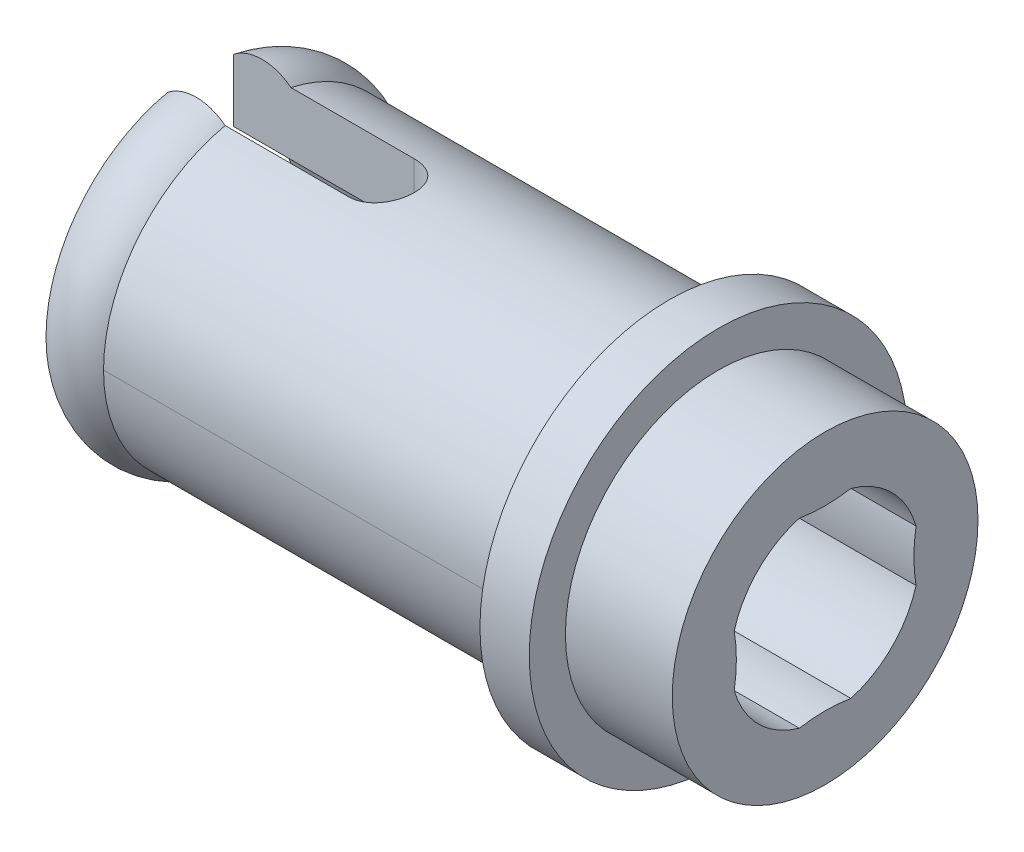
ISO-10303-21;
HEADER;
FILE_DESCRIPTION(('STEP AP214'),'2;1');
FILE_NAME('part.step','',(''),(''),'','','');
FILE_SCHEMA(('AUTOMOTIVE_DESIGN { 1 0 10303 214 1 1 1 1 }'));
ENDSEC;
DATA;
#1=APPLICATION_CONTEXT('core data for automotive mechanical design processes');
#2=APPLICATION_PROTOCOL_DEFINITION('international standard','automotive_design',2000,#1);
#3=PRODUCT_CONTEXT('',#1,'mechanical');
#4=PRODUCT('Part','Part','',(#3));
#5=PRODUCT_RELATED_PRODUCT_CATEGORY('part','',(#4));
#6=PRODUCT_DEFINITION_FORMATION('','',#4);
#7=PRODUCT_DEFINITION_CONTEXT('part definition',#1,'design');
#8=PRODUCT_DEFINITION('design','',#6,#7);
#9=PRODUCT_DEFINITION_SHAPE('','',#8);
#10=(LENGTH_UNIT() NAMED_UNIT(*) SI_UNIT(.MILLI.,.METRE.));
#11=(NAMED_UNIT(*) PLANE_ANGLE_UNIT() SI_UNIT($,.RADIAN.));
#12=(NAMED_UNIT(*) SI_UNIT($,.STERADIAN.) SOLID_ANGLE_UNIT());
#13=UNCERTAINTY_MEASURE_WITH_UNIT(LENGTH_MEASURE(1.E-05),#10,'distance_accuracy_value','');
#14=(GEOMETRIC_REPRESENTATION_CONTEXT(3) GLOBAL_UNCERTAINTY_ASSIGNED_CONTEXT((#13)) GLOBAL_UNIT_ASSIGNED_CONTEXT((#10,
#11,#12)) REPRESENTATION_CONTEXT('',''));
#15=CARTESIAN_POINT('',(0.,0.,0.));
#16=DIRECTION('',(0.,0.,1.));
#17=DIRECTION('',(1.,0.,0.));
#18=AXIS2_PLACEMENT_3D('',#15,#16,#17);
#19=CARTESIAN_POINT('',(1.651,0.,0.));
#20=DIRECTION('',(-1.,0.,0.));
#21=DIRECTION('',(0.,0.,1.));
#22=AXIS2_PLACEMENT_3D('',#19,#20,#21);
#23=CYLINDRICAL_SURFACE('',#22,1.4605);
#24=DIRECTION('',(-1.,0.,0.));
#25=VECTOR('',#24,1.);
#26=CARTESIAN_POINT('',(1.651,-1.36930502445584,-0.508000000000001));
#27=LINE('',#26,#25);
#28=CARTESIAN_POINT('',(-5.207,-1.36930502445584,-0.508000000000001));
#29=VERTEX_POINT('',#28);
#30=CARTESIAN_POINT('',(-8.001,-1.36930502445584,-0.508000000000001));
#31=VERTEX_POINT('',#30);
#32=EDGE_CURVE('E11',#29,#31,#27,.T.);
#33=ORIENTED_EDGE('',*,*,#32,.F.);
#34=CARTESIAN_POINT('',(-5.207,-1.36930502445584,0.508));
#35=CARTESIAN_POINT('',(-5.17934794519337,-1.36927072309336,0.508028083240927));
#36=CARTESIAN_POINT('',(-5.15172378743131,-1.37014185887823,0.505744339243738));
#37=CARTESIAN_POINT('',(-5.09737925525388,-1.37342804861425,0.496784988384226));
#38=CARTESIAN_POINT('',(-5.07065624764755,-1.37583810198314,0.490123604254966));
#39=CARTESIAN_POINT('',(-5.0187902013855,-1.38193636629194,0.472643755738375));
#40=CARTESIAN_POINT('',(-4.9936461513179,-1.38562374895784,0.461827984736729));
#41=CARTESIAN_POINT('',(-4.94550852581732,-1.39384797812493,0.436380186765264));
#42=CARTESIAN_POINT('',(-4.92251643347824,-1.39838540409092,0.421745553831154));
#43=CARTESIAN_POINT('',(-4.87837350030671,-1.40801588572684,0.388410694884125));
#44=CARTESIAN_POINT('',(-4.85732767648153,-1.4131236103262,0.369575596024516));
#45=CARTESIAN_POINT('',(-4.81862037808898,-1.42319542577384,0.328661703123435));
#46=CARTESIAN_POINT('',(-4.80095952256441,-1.4281594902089,0.306582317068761));
#47=CARTESIAN_POINT('',(-4.76903459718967,-1.43755694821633,0.259024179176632));
#48=CARTESIAN_POINT('',(-4.75488261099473,-1.44197101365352,0.233466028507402));
#49=CARTESIAN_POINT('',(-4.73112187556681,-1.44959615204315,0.180152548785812));
#50=CARTESIAN_POINT('',(-4.7215116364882,-1.45280761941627,0.152397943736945));
#51=CARTESIAN_POINT('',(-4.70746860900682,-1.45756157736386,0.0965865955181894));
#52=CARTESIAN_POINT('',(-4.70285466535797,-1.45916230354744,0.068580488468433));
#53=CARTESIAN_POINT('',(-4.698357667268,-1.46072191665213,0.0121483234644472));
#54=CARTESIAN_POINT('',(-4.69847337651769,-1.46068123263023,-0.0162776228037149));
#55=CARTESIAN_POINT('',(-4.70332082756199,-1.45900120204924,-0.0714540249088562));
#56=CARTESIAN_POINT('',(-4.7078554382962,-1.45743012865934,-0.098224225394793));
#57=CARTESIAN_POINT('',(-4.72108402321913,-1.45295288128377,-0.150596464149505));
#58=CARTESIAN_POINT('',(-4.72977823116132,-1.45004663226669,-0.176198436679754));
#59=CARTESIAN_POINT('',(-4.75118620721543,-1.44314198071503,-0.225921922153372));
#60=CARTESIAN_POINT('',(-4.76395344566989,-1.43912915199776,-0.250018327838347));
#61=CARTESIAN_POINT('',(-4.79310006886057,-1.43042521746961,-0.29578266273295));
#62=CARTESIAN_POINT('',(-4.80948050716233,-1.42573391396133,-0.317449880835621));
#63=CARTESIAN_POINT('',(-4.84636573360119,-1.4158820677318,-0.35890857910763));
#64=CARTESIAN_POINT('',(-4.867037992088,-1.41070979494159,-0.378548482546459));
#65=CARTESIAN_POINT('',(-4.91142731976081,-1.40067586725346,-0.414137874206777));
#66=CARTESIAN_POINT('',(-4.9351454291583,-1.39581431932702,-0.430086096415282));
#67=CARTESIAN_POINT('',(-4.98547762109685,-1.38688323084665,-0.458077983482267));
#68=CARTESIAN_POINT('',(-5.01213457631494,-1.38282878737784,-0.470049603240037));
#69=CARTESIAN_POINT('',(-5.06724967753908,-1.37614795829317,-0.489266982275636));
#70=CARTESIAN_POINT('',(-5.09570484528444,-1.37351927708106,-0.496520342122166));
#71=CARTESIAN_POINT('',(-5.1382019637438,-1.37096428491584,-0.503509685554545));
#72=CARTESIAN_POINT('',(-5.15190763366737,-1.37034402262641,-0.505192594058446));
#73=CARTESIAN_POINT('',(-5.17940635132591,-1.36951399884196,-0.507437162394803));
#74=CARTESIAN_POINT('',(-5.19319927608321,-1.36930375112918,-0.508000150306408));
#75=CARTESIAN_POINT('',(-5.207,-1.36930502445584,-0.508000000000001));
#76=B_SPLINE_CURVE_WITH_KNOTS('',3,(#34,#35,#36,#37,#38,#39,#40,#41,#42,#43,#44,#45,#46,#47,#48,
#49,#50,#51,#52,#53,#54,#55,#56,#57,#58,#59,#60,#61,#62,#63,#64,#65,#66,#67,#68,#69,#70,#71,#72,
#73,#74,#75),.UNSPECIFIED.,.F.,.F.,(4,2,2,2,2,2,2,2,2,2,2,2,2,2,2,2,2,2,2,2,4),(0.,
0.0828047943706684,0.165341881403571,0.247825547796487,0.330365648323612,0.41608465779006,
0.501819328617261,0.590015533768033,0.678182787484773,0.763033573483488,0.847862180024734,
0.929071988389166,1.01028636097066,1.092614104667,1.1749658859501,1.26150868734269,
1.34808112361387,1.43614588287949,1.52406842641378,1.56549143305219,1.60686528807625),.UNSPECIFIED.);
#77=CARTESIAN_POINT('',(-5.207,-1.36930502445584,0.508));
#78=VERTEX_POINT('',#77);
#79=EDGE_CURVE('E42',#78,#29,#76,.T.);
#80=ORIENTED_EDGE('',*,*,#79,.F.);
#81=DIRECTION('',(-1.,0.,0.));
#82=VECTOR('',#81,1.);
#83=CARTESIAN_POINT('',(1.651,-1.36930502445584,0.508000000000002));
#84=LINE('',#83,#82);
#85=CARTESIAN_POINT('',(-8.001,-1.36930502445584,0.508000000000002));
#86=VERTEX_POINT('',#85);
#87=EDGE_CURVE('E361',#86,#78,#84,.F.);
#88=ORIENTED_EDGE('',*,*,#87,.F.);
#89=CARTESIAN_POINT('',(-8.001,0.,0.));
#90=DIRECTION('',(-1.,0.,0.));
#91=DIRECTION('',(0.,0.,1.));
#92=AXIS2_PLACEMENT_3D('',#89,#90,#91);
#93=CIRCLE('',#92,1.4605);
#94=CARTESIAN_POINT('',(-8.001,1.36930502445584,0.507999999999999));
#95=VERTEX_POINT('',#94);
#96=EDGE_CURVE('E195',#86,#95,#93,.T.);
#97=ORIENTED_EDGE('',*,*,#96,.T.);
#98=DIRECTION('',(-1.,0.,0.));
#99=VECTOR('',#98,1.);
#100=CARTESIAN_POINT('',(1.651,1.36930502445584,0.508000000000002));
#101=LINE('',#100,#99);
#102=CARTESIAN_POINT('',(-5.207,1.36930502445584,0.508000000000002));
#103=VERTEX_POINT('',#102);
#104=EDGE_CURVE('E229',#103,#95,#101,.T.);
#105=ORIENTED_EDGE('',*,*,#104,.F.);
#106=CARTESIAN_POINT('',(-5.207,1.36930502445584,-0.508000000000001));
#107=CARTESIAN_POINT('',(-5.17934794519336,1.36927072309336,-0.508028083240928));
#108=CARTESIAN_POINT('',(-5.15172378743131,1.37014185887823,-0.505744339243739));
#109=CARTESIAN_POINT('',(-5.09737925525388,1.37342804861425,-0.496784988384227));
#110=CARTESIAN_POINT('',(-5.07065624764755,1.37583810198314,-0.490123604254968));
#111=CARTESIAN_POINT('',(-5.0187902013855,1.38193636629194,-0.472643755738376));
#112=CARTESIAN_POINT('',(-4.9936461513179,1.38562374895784,-0.461827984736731));
#113=CARTESIAN_POINT('',(-4.94550852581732,1.39384797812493,-0.436380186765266));
#114=CARTESIAN_POINT('',(-4.92251643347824,1.39838540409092,-0.421745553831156));
#115=CARTESIAN_POINT('',(-4.87837350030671,1.40801588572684,-0.388410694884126));
#116=CARTESIAN_POINT('',(-4.85732767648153,1.4131236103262,-0.369575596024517));
#117=CARTESIAN_POINT('',(-4.81862037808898,1.42319542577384,-0.328661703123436));
#118=CARTESIAN_POINT('',(-4.80095952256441,1.4281594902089,-0.306582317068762));
#119=CARTESIAN_POINT('',(-4.76903459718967,1.43755694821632,-0.259024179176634));
#120=CARTESIAN_POINT('',(-4.75488261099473,1.44197101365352,-0.233466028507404));
#121=CARTESIAN_POINT('',(-4.73112187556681,1.44959615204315,-0.180152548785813));
#122=CARTESIAN_POINT('',(-4.7215116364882,1.45280761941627,-0.152397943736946));
#123=CARTESIAN_POINT('',(-4.70746860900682,1.45756157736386,-0.0965865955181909));
#124=CARTESIAN_POINT('',(-4.70285466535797,1.45916230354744,-0.0685804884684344));
#125=CARTESIAN_POINT('',(-4.698357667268,1.46072191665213,-0.0121483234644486));
#126=CARTESIAN_POINT('',(-4.69847337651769,1.46068123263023,0.0162776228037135));
#127=CARTESIAN_POINT('',(-4.70332082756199,1.45900120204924,0.0714540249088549));
#128=CARTESIAN_POINT('',(-4.7078554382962,1.45743012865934,0.0982242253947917));
#129=CARTESIAN_POINT('',(-4.72108402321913,1.45295288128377,0.150596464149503));
#130=CARTESIAN_POINT('',(-4.72977823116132,1.45004663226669,0.176198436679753));
#131=CARTESIAN_POINT('',(-4.75118620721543,1.44314198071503,0.22592192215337));
#132=CARTESIAN_POINT('',(-4.76395344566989,1.43912915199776,0.250018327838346));
#133=CARTESIAN_POINT('',(-4.79310006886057,1.43042521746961,0.295782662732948));
#134=CARTESIAN_POINT('',(-4.80948050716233,1.42573391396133,0.317449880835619));
#135=CARTESIAN_POINT('',(-4.84636573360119,1.4158820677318,0.358908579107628));
#136=CARTESIAN_POINT('',(-4.867037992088,1.41070979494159,0.378548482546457));
#137=CARTESIAN_POINT('',(-4.91142731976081,1.40067586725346,0.414137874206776));
#138=CARTESIAN_POINT('',(-4.9351454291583,1.39581431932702,0.430086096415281));
#139=CARTESIAN_POINT('',(-4.98547762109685,1.38688323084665,0.458077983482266));
#140=CARTESIAN_POINT('',(-5.01213457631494,1.38282878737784,0.470049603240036));
#141=CARTESIAN_POINT('',(-5.06724967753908,1.37614795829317,0.489266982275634));
#142=CARTESIAN_POINT('',(-5.09570484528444,1.37351927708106,0.496520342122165));
#143=CARTESIAN_POINT('',(-5.1382019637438,1.37096428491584,0.503509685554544));
#144=CARTESIAN_POINT('',(-5.15190763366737,1.37034402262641,0.505192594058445));
#145=CARTESIAN_POINT('',(-5.17940635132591,1.36951399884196,0.507437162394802));
#146=CARTESIAN_POINT('',(-5.19319927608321,1.36930375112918,0.508000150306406));
#147=CARTESIAN_POINT('',(-5.207,1.36930502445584,0.508));
#148=B_SPLINE_CURVE_WITH_KNOTS('',3,(#106,#107,#108,#109,#110,#111,#112,#113,#114,#115,#116,
#117,#118,#119,#120,#121,#122,#123,#124,#125,#126,#127,#128,#129,#130,#131,#132,#133,#134,#135,
#136,#137,#138,#139,#140,#141,#142,#143,#144,#145,#146,#147),.UNSPECIFIED.,.F.,.F.,(4,2,2,2,2,2,
2,2,2,2,2,2,2,2,2,2,2,2,2,2,4),(0.,0.0828047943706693,0.165341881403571,0.247825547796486,
0.330365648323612,0.41608465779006,0.501819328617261,0.590015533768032,0.678182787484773,
0.763033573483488,0.847862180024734,0.929071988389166,1.01028636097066,1.092614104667,
1.1749658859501,1.26150868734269,1.34808112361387,1.43614588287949,1.52406842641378,
1.56549143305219,1.60686528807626),.UNSPECIFIED.);
#149=CARTESIAN_POINT('',(-5.207,1.36930502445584,-0.508000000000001));
#150=VERTEX_POINT('',#149);
#151=EDGE_CURVE('E231',#150,#103,#148,.T.);
#152=ORIENTED_EDGE('',*,*,#151,.F.);
#153=DIRECTION('',(-1.,0.,0.));
#154=VECTOR('',#153,1.);
#155=CARTESIAN_POINT('',(1.651,1.36930502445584,-0.508000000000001));
#156=LINE('',#155,#154);
#157=CARTESIAN_POINT('',(-8.001,1.36930502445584,-0.508000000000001));
#158=VERTEX_POINT('',#157);
#159=EDGE_CURVE('E239',#158,#150,#156,.F.);
#160=ORIENTED_EDGE('',*,*,#159,.F.);
#161=EDGE_CURVE('E191',#158,#31,#93,.T.);
#162=ORIENTED_EDGE('',*,*,#161,.T.);
#163=EDGE_LOOP('',(#33,#80,#88,#97,#105,#152,#160,#162));
#164=FACE_BOUND('',#163,.T.);
#165=DIRECTION('',(1.,0.,0.));
#166=VECTOR('',#165,1.);
#167=CARTESIAN_POINT('',(-2.286,0.398483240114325,1.40508766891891));
#168=LINE('',#167,#166);
#169=CARTESIAN_POINT('',(-2.286,0.398483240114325,1.40508766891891));
#170=VERTEX_POINT('',#169);
#171=CARTESIAN_POINT('',(1.651,0.398483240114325,1.40508766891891));
#172=VERTEX_POINT('',#171);
#173=EDGE_CURVE('E173',#170,#172,#168,.T.);
#174=ORIENTED_EDGE('',*,*,#173,.F.);
#175=CARTESIAN_POINT('',(-2.286,0.,0.));
#176=DIRECTION('',(1.,0.,0.));
#177=DIRECTION('',(0.,1.,0.));
#178=AXIS2_PLACEMENT_3D('',#175,#176,#177);
#179=CIRCLE('',#178,1.4605);
#180=CARTESIAN_POINT('',(-2.286,-0.398483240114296,1.40508766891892));
#181=VERTEX_POINT('',#180);
#182=EDGE_CURVE('E182',#170,#181,#179,.T.);
#183=ORIENTED_EDGE('',*,*,#182,.T.);
#184=DIRECTION('',(1.,0.,0.));
#185=VECTOR('',#184,1.);
#186=CARTESIAN_POINT('',(-2.286,-0.398483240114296,1.40508766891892));
#187=LINE('',#186,#185);
#188=CARTESIAN_POINT('',(1.651,-0.398483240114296,1.40508766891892));
#189=VERTEX_POINT('',#188);
#190=EDGE_CURVE('E170',#181,#189,#187,.T.);
#191=ORIENTED_EDGE('',*,*,#190,.T.);
#192=CARTESIAN_POINT('',(1.651,0.,0.));
#193=DIRECTION('',(-1.,0.,0.));
#194=DIRECTION('',(0.,0.,1.));
#195=AXIS2_PLACEMENT_3D('',#192,#193,#194);
#196=CIRCLE('',#195,1.4605);
#197=CARTESIAN_POINT('',(1.651,-1.40508766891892,0.39848324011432));
#198=VERTEX_POINT('',#197);
#199=EDGE_CURVE('E180',#198,#189,#196,.T.);
#200=ORIENTED_EDGE('',*,*,#199,.F.);
#201=DIRECTION('',(1.,0.,0.));
#202=VECTOR('',#201,1.);
#203=CARTESIAN_POINT('',(-2.286,-1.40508766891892,0.39848324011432));
#204=LINE('',#203,#202);
#205=CARTESIAN_POINT('',(-2.286,-1.40508766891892,0.39848324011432));
#206=VERTEX_POINT('',#205);
#207=EDGE_CURVE('E644',#206,#198,#204,.T.);
#208=ORIENTED_EDGE('',*,*,#207,.F.);
#209=CARTESIAN_POINT('',(-2.286,0.,0.));
#210=DIRECTION('',(1.,0.,0.));
#211=DIRECTION('',(0.,0.,1.));
#212=AXIS2_PLACEMENT_3D('',#209,#210,#211);
#213=CIRCLE('',#212,1.4605);
#214=CARTESIAN_POINT('',(-2.286,-1.40508766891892,-0.3984832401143));
#215=VERTEX_POINT('',#214);
#216=EDGE_CURVE('E641',#206,#215,#213,.T.);
#217=ORIENTED_EDGE('',*,*,#216,.T.);
#218=DIRECTION('',(1.,0.,0.));
#219=VECTOR('',#218,1.);
#220=CARTESIAN_POINT('',(-2.286,-1.40508766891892,-0.3984832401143));
#221=LINE('',#220,#219);
#222=CARTESIAN_POINT('',(1.651,-1.40508766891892,-0.3984832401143));
#223=VERTEX_POINT('',#222);
#224=EDGE_CURVE('E646',#215,#223,#221,.T.);
#225=ORIENTED_EDGE('',*,*,#224,.T.);
#226=CARTESIAN_POINT('',(1.651,-0.398483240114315,-1.40508766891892));
#227=VERTEX_POINT('',#226);
#228=EDGE_CURVE('E187',#227,#223,#196,.T.);
#229=ORIENTED_EDGE('',*,*,#228,.F.);
#230=DIRECTION('',(1.,0.,0.));
#231=VECTOR('',#230,1.);
#232=CARTESIAN_POINT('',(-2.286,-0.398483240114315,-1.40508766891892));
#233=LINE('',#232,#231);
#234=CARTESIAN_POINT('',(-2.286,-0.398483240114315,-1.40508766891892));
#235=VERTEX_POINT('',#234);
#236=EDGE_CURVE('E656',#235,#227,#233,.T.);
#237=ORIENTED_EDGE('',*,*,#236,.F.);
#238=CARTESIAN_POINT('',(-2.286,0.,0.));
#239=DIRECTION('',(1.,0.,0.));
#240=DIRECTION('',(0.,-1.,0.));
#241=AXIS2_PLACEMENT_3D('',#238,#239,#240);
#242=CIRCLE('',#241,1.4605);
#243=CARTESIAN_POINT('',(-2.286,0.398483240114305,-1.40508766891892));
#244=VERTEX_POINT('',#243);
#245=EDGE_CURVE('E653',#235,#244,#242,.T.);
#246=ORIENTED_EDGE('',*,*,#245,.T.);
#247=DIRECTION('',(1.,0.,0.));
#248=VECTOR('',#247,1.);
#249=CARTESIAN_POINT('',(-2.286,0.398483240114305,-1.40508766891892));
#250=LINE('',#249,#248);
#251=CARTESIAN_POINT('',(1.651,0.398483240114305,-1.40508766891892));
#252=VERTEX_POINT('',#251);
#253=EDGE_CURVE('E659',#244,#252,#250,.T.);
#254=ORIENTED_EDGE('',*,*,#253,.T.);
#255=CARTESIAN_POINT('',(1.651,1.40508766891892,-0.39848324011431));
#256=VERTEX_POINT('',#255);
#257=EDGE_CURVE('E190',#256,#252,#196,.T.);
#258=ORIENTED_EDGE('',*,*,#257,.F.);
#259=DIRECTION('',(1.,0.,0.));
#260=VECTOR('',#259,1.);
#261=CARTESIAN_POINT('',(-2.286,1.40508766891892,-0.39848324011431));
#262=LINE('',#261,#260);
#263=CARTESIAN_POINT('',(-2.286,1.40508766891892,-0.39848324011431));
#264=VERTEX_POINT('',#263);
#265=EDGE_CURVE('E374',#264,#256,#262,.T.);
#266=ORIENTED_EDGE('',*,*,#265,.F.);
#267=CARTESIAN_POINT('',(-2.286,0.,0.));
#268=DIRECTION('',(1.,0.,0.));
#269=DIRECTION('',(0.,0.,-1.));
#270=AXIS2_PLACEMENT_3D('',#267,#268,#269);
#271=CIRCLE('',#270,1.4605);
#272=CARTESIAN_POINT('',(-2.286,1.40508766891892,0.39848324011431));
#273=VERTEX_POINT('',#272);
#274=EDGE_CURVE('E667',#264,#273,#271,.T.);
#275=ORIENTED_EDGE('',*,*,#274,.T.);
#276=DIRECTION('',(1.,0.,0.));
#277=VECTOR('',#276,1.);
#278=CARTESIAN_POINT('',(-2.286,1.40508766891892,0.39848324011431));
#279=LINE('',#278,#277);
#280=CARTESIAN_POINT('',(1.651,1.40508766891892,0.39848324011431));
#281=VERTEX_POINT('',#280);
#282=EDGE_CURVE('E370',#273,#281,#279,.T.);
#283=ORIENTED_EDGE('',*,*,#282,.T.);
#284=EDGE_CURVE('E188',#172,#281,#196,.T.);
#285=ORIENTED_EDGE('',*,*,#284,.F.);
#286=EDGE_LOOP('',(#174,#183,#191,#200,#208,#217,#225,#229,#237,#246,#254,#258,#266,#275,#283,#285));
#287=FACE_BOUND('',#286,.T.);
#288=ADVANCED_FACE('F34',(#164,#287),#23,.F.);
#289=CARTESIAN_POINT('',(-8.001,0.,0.));
#290=DIRECTION('',(1.,0.,0.));
#291=DIRECTION('',(0.,0.,-1.));
#292=AXIS2_PLACEMENT_3D('',#289,#290,#291);
#293=CYLINDRICAL_SURFACE('',#292,2.3876);
#294=DIRECTION('',(1.,0.,0.));
#295=VECTOR('',#294,1.);
#296=CARTESIAN_POINT('',(-8.001,-2.33293158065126,-0.508000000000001));
#297=LINE('',#296,#295);
#298=CARTESIAN_POINT('',(-7.11199999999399,-2.33293158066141,-0.508000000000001));
#299=VERTEX_POINT('',#298);
#300=CARTESIAN_POINT('',(-5.207,-2.33293158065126,-0.508000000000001));
#301=VERTEX_POINT('',#300);
#302=EDGE_CURVE('E355',#299,#301,#297,.T.);
#303=ORIENTED_EDGE('',*,*,#302,.F.);
#304=CARTESIAN_POINT('',(-7.112,0.,0.));
#305=DIRECTION('',(1.,0.,0.));
#306=DIRECTION('',(0.,0.,-1.));
#307=AXIS2_PLACEMENT_3D('',#304,#305,#306);
#308=CIRCLE('',#307,2.3876);
#309=CARTESIAN_POINT('',(-7.112,0.,-2.3876));
#310=VERTEX_POINT('',#309);
#311=EDGE_CURVE('E194',#299,#310,#308,.T.);
#312=ORIENTED_EDGE('',*,*,#311,.T.);
#313=DIRECTION('',(1.,0.,0.));
#314=VECTOR('',#313,1.);
#315=CARTESIAN_POINT('',(-8.001,0.,-2.3876));
#316=LINE('',#315,#314);
#317=CARTESIAN_POINT('',(-0.762,0.,-2.3876));
#318=VERTEX_POINT('',#317);
#319=EDGE_CURVE('E226',#310,#318,#316,.T.);
#320=ORIENTED_EDGE('',*,*,#319,.T.);
#321=CARTESIAN_POINT('',(-0.762,0.,0.));
#322=DIRECTION('',(-1.,0.,0.));
#323=DIRECTION('',(0.,0.,1.));
#324=AXIS2_PLACEMENT_3D('',#321,#322,#323);
#325=CIRCLE('',#324,2.3876);
#326=CARTESIAN_POINT('',(-0.762,0.,2.3876));
#327=VERTEX_POINT('',#326);
#328=EDGE_CURVE('E200',#318,#327,#325,.T.);
#329=ORIENTED_EDGE('',*,*,#328,.T.);
#330=DIRECTION('',(-1.,0.,0.));
#331=VECTOR('',#330,1.);
#332=CARTESIAN_POINT('',(-8.001,0.,2.3876));
#333=LINE('',#332,#331);
#334=CARTESIAN_POINT('',(-7.112,0.,2.3876));
#335=VERTEX_POINT('',#334);
#336=EDGE_CURVE('E222',#327,#335,#333,.T.);
#337=ORIENTED_EDGE('',*,*,#336,.T.);
#338=CARTESIAN_POINT('',(-7.11199999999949,-2.33293158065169,0.507999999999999));
#339=VERTEX_POINT('',#338);
#340=EDGE_CURVE('E202',#335,#339,#308,.T.);
#341=ORIENTED_EDGE('',*,*,#340,.T.);
#342=DIRECTION('',(1.,0.,0.));
#343=VECTOR('',#342,1.);
#344=CARTESIAN_POINT('',(-8.001,-2.33293158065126,0.507999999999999));
#345=LINE('',#344,#343);
#346=CARTESIAN_POINT('',(-5.207,-2.33293158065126,0.508));
#347=VERTEX_POINT('',#346);
#348=EDGE_CURVE('E270',#347,#339,#345,.F.);
#349=ORIENTED_EDGE('',*,*,#348,.F.);
#350=CARTESIAN_POINT('',(-5.207,-2.33293158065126,-0.508000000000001));
#351=CARTESIAN_POINT('',(-5.17876432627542,-2.33291136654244,-0.508025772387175));
#352=CARTESIAN_POINT('',(-5.15054333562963,-2.33344365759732,-0.505647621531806));
#353=CARTESIAN_POINT('',(-5.09495811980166,-2.33546100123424,-0.496282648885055));
#354=CARTESIAN_POINT('',(-5.06759253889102,-2.33694445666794,-0.48930355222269));
#355=CARTESIAN_POINT('',(-5.01444407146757,-2.3407129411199,-0.470934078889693));
#356=CARTESIAN_POINT('',(-4.98866128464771,-2.34299802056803,-0.459543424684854));
#357=CARTESIAN_POINT('',(-4.93936676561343,-2.34810502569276,-0.432693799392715));
#358=CARTESIAN_POINT('',(-4.91585535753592,-2.35092702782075,-0.417234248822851));
#359=CARTESIAN_POINT('',(-4.87140373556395,-2.35684134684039,-0.382423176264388));
#360=CARTESIAN_POINT('',(-4.85050486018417,-2.35993693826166,-0.363019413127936));
#361=CARTESIAN_POINT('',(-4.81223091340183,-2.36602084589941,-0.32098209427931));
#362=CARTESIAN_POINT('',(-4.79485639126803,-2.36900914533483,-0.29834803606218));
#363=CARTESIAN_POINT('',(-4.76396285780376,-2.37457737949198,-0.250215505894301));
#364=CARTESIAN_POINT('',(-4.75048375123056,-2.37715297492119,-0.224690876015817));
#365=CARTESIAN_POINT('',(-4.7280222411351,-2.38156829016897,-0.171676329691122));
#366=CARTESIAN_POINT('',(-4.71903912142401,-2.3834081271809,-0.144186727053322));
#367=CARTESIAN_POINT('',(-4.70595412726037,-2.38612155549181,-0.0884542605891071));
#368=CARTESIAN_POINT('',(-4.70178179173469,-2.38700908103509,-0.0602286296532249));
#369=CARTESIAN_POINT('',(-4.6982166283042,-2.38776612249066,-0.00346435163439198));
#370=CARTESIAN_POINT('',(-4.69882339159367,-2.3876357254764,0.0250742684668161));
#371=CARTESIAN_POINT('',(-4.7047465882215,-2.38638227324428,0.0811678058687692));
#372=CARTESIAN_POINT('',(-4.70998697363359,-2.38527524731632,0.108731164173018));
#373=CARTESIAN_POINT('',(-4.72490761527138,-2.38221113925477,0.162577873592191));
#374=CARTESIAN_POINT('',(-4.73458803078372,-2.38025402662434,0.188861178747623));
#375=CARTESIAN_POINT('',(-4.75818239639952,-2.37568362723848,0.239615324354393));
#376=CARTESIAN_POINT('',(-4.77212555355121,-2.3730658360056,0.264072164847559));
#377=CARTESIAN_POINT('',(-4.80382751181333,-2.36746174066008,0.310326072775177));
#378=CARTESIAN_POINT('',(-4.82158669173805,-2.36447539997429,0.332122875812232));
#379=CARTESIAN_POINT('',(-4.86082905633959,-2.3583939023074,0.372888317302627));
#380=CARTESIAN_POINT('',(-4.88237837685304,-2.35529775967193,0.391793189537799));
#381=CARTESIAN_POINT('',(-4.92838011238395,-2.34939982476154,0.425737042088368));
#382=CARTESIAN_POINT('',(-4.95283332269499,-2.34659811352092,0.44077495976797));
#383=CARTESIAN_POINT('',(-5.00405171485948,-2.34160336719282,0.466584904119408));
#384=CARTESIAN_POINT('',(-5.03082410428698,-2.33941232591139,0.477343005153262));
#385=CARTESIAN_POINT('',(-5.08583722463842,-2.33591539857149,0.494174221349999));
#386=CARTESIAN_POINT('',(-5.11407570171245,-2.33460819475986,0.500254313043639));
#387=CARTESIAN_POINT('',(-5.153287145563,-2.33352507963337,0.505267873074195));
#388=CARTESIAN_POINT('',(-5.16401220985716,-2.33330278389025,0.506292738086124));
#389=CARTESIAN_POINT('',(-5.18548988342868,-2.33300614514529,0.507657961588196));
#390=CARTESIAN_POINT('',(-5.19624241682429,-2.33293155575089,0.50799946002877));
#391=CARTESIAN_POINT('',(-5.207,-2.33293158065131,0.508000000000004));
#392=B_SPLINE_CURVE_WITH_KNOTS('',3,(#350,#351,#352,#353,#354,#355,#356,#357,#358,#359,#360,
#361,#362,#363,#364,#365,#366,#367,#368,#369,#370,#371,#372,#373,#374,#375,#376,#377,#378,#379,
#380,#381,#382,#383,#384,#385,#386,#387,#388,#389,#390,#391),.UNSPECIFIED.,.F.,.F.,(4,2,2,2,2,2,
2,2,2,2,2,2,2,2,2,2,2,2,2,2,4),(0.,0.08457969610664,0.169017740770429,0.253461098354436,
0.337916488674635,0.423573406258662,0.509243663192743,0.595762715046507,0.682267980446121,
0.767489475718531,0.852703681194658,0.936544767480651,1.02038886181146,1.1048208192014,
1.18926116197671,1.27535563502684,1.36147374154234,1.44786981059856,1.53413678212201,
1.56644773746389,1.59870474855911),.UNSPECIFIED.);
#393=EDGE_CURVE('E269',#301,#347,#392,.T.);
#394=ORIENTED_EDGE('',*,*,#393,.F.);
#395=EDGE_LOOP('',(#303,#312,#320,#329,#337,#341,#349,#394));
#396=FACE_BOUND('',#395,.T.);
#397=ADVANCED_FACE('F276',(#396),#293,.T.);
#398=DIRECTION('',(1.,0.,0.));
#399=VECTOR('',#398,1.);
#400=CARTESIAN_POINT('',(-8.001,2.33293158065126,-0.508000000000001));
#401=LINE('',#400,#399);
#402=CARTESIAN_POINT('',(-5.207,2.33293158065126,-0.508000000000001));
#403=VERTEX_POINT('',#402);
#404=CARTESIAN_POINT('',(-7.112,2.33293158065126,-0.508000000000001));
#405=VERTEX_POINT('',#404);
#406=EDGE_CURVE('E351',#403,#405,#401,.F.);
#407=ORIENTED_EDGE('',*,*,#406,.F.);
#408=CARTESIAN_POINT('',(-5.207,2.33293158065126,0.508));
#409=CARTESIAN_POINT('',(-5.17876432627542,2.33291136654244,0.508025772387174));
#410=CARTESIAN_POINT('',(-5.15054333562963,2.33344365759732,0.505647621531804));
#411=CARTESIAN_POINT('',(-5.09495811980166,2.33546100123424,0.496282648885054));
#412=CARTESIAN_POINT('',(-5.06759253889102,2.33694445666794,0.489303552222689));
#413=CARTESIAN_POINT('',(-5.01444407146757,2.3407129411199,0.470934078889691));
#414=CARTESIAN_POINT('',(-4.98866128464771,2.34299802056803,0.459543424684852));
#415=CARTESIAN_POINT('',(-4.93936676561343,2.34810502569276,0.432693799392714));
#416=CARTESIAN_POINT('',(-4.91585535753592,2.35092702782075,0.41723424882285));
#417=CARTESIAN_POINT('',(-4.87140373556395,2.35684134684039,0.382423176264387));
#418=CARTESIAN_POINT('',(-4.85050486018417,2.35993693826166,0.363019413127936));
#419=CARTESIAN_POINT('',(-4.81223091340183,2.36602084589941,0.32098209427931));
#420=CARTESIAN_POINT('',(-4.79485639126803,2.36900914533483,0.298348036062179));
#421=CARTESIAN_POINT('',(-4.76396285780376,2.37457737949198,0.250215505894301));
#422=CARTESIAN_POINT('',(-4.75048375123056,2.37715297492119,0.224690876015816));
#423=CARTESIAN_POINT('',(-4.7280222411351,2.38156829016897,0.171676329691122));
#424=CARTESIAN_POINT('',(-4.71903912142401,2.3834081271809,0.144186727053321));
#425=CARTESIAN_POINT('',(-4.70595412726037,2.38612155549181,0.0884542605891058));
#426=CARTESIAN_POINT('',(-4.70178179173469,2.38700908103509,0.0602286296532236));
#427=CARTESIAN_POINT('',(-4.6982166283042,2.38776612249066,0.00346435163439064));
#428=CARTESIAN_POINT('',(-4.69882339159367,2.3876357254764,-0.0250742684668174));
#429=CARTESIAN_POINT('',(-4.7047465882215,2.38638227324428,-0.0811678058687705));
#430=CARTESIAN_POINT('',(-4.70998697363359,2.38527524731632,-0.10873116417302));
#431=CARTESIAN_POINT('',(-4.72490761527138,2.38221113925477,-0.162577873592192));
#432=CARTESIAN_POINT('',(-4.73458803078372,2.38025402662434,-0.188861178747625));
#433=CARTESIAN_POINT('',(-4.75818239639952,2.37568362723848,-0.239615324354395));
#434=CARTESIAN_POINT('',(-4.77212555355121,2.3730658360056,-0.264072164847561));
#435=CARTESIAN_POINT('',(-4.80382751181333,2.36746174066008,-0.310326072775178));
#436=CARTESIAN_POINT('',(-4.82158669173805,2.36447539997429,-0.332122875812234));
#437=CARTESIAN_POINT('',(-4.86082905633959,2.3583939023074,-0.372888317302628));
#438=CARTESIAN_POINT('',(-4.88237837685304,2.35529775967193,-0.3917931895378));
#439=CARTESIAN_POINT('',(-4.92838011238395,2.34939982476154,-0.425737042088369));
#440=CARTESIAN_POINT('',(-4.95283332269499,2.34659811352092,-0.440774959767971));
#441=CARTESIAN_POINT('',(-5.00405171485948,2.34160336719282,-0.466584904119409));
#442=CARTESIAN_POINT('',(-5.03082410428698,2.33941232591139,-0.477343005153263));
#443=CARTESIAN_POINT('',(-5.08583722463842,2.33591539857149,-0.49417422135));
#444=CARTESIAN_POINT('',(-5.11407570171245,2.33460819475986,-0.500254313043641));
#445=CARTESIAN_POINT('',(-5.153287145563,2.33352507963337,-0.505267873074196));
#446=CARTESIAN_POINT('',(-5.16401220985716,2.33330278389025,-0.506292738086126));
#447=CARTESIAN_POINT('',(-5.18548988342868,2.33300614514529,-0.507657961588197));
#448=CARTESIAN_POINT('',(-5.19624241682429,2.33293155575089,-0.507999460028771));
#449=CARTESIAN_POINT('',(-5.207,2.33293158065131,-0.508000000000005));
#450=B_SPLINE_CURVE_WITH_KNOTS('',3,(#408,#409,#410,#411,#412,#413,#414,#415,#416,#417,#418,
#419,#420,#421,#422,#423,#424,#425,#426,#427,#428,#429,#430,#431,#432,#433,#434,#435,#436,#437,
#438,#439,#440,#441,#442,#443,#444,#445,#446,#447,#448,#449),.UNSPECIFIED.,.F.,.F.,(4,2,2,2,2,2,
2,2,2,2,2,2,2,2,2,2,2,2,2,2,4),(0.,0.08457969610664,0.169017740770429,0.253461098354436,
0.337916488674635,0.423573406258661,0.509243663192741,0.595762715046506,0.682267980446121,
0.767489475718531,0.852703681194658,0.936544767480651,1.02038886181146,1.1048208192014,
1.18926116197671,1.27535563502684,1.36147374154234,1.44786981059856,1.53413678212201,
1.56644773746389,1.59870474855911),.UNSPECIFIED.);
#451=CARTESIAN_POINT('',(-5.207,2.33293158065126,0.508));
#452=VERTEX_POINT('',#451);
#453=EDGE_CURVE('E263',#452,#403,#450,.T.);
#454=ORIENTED_EDGE('',*,*,#453,.F.);
#455=DIRECTION('',(1.,0.,0.));
#456=VECTOR('',#455,1.);
#457=CARTESIAN_POINT('',(-8.001,2.33293158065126,0.507999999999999));
#458=LINE('',#457,#456);
#459=CARTESIAN_POINT('',(-7.11199999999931,2.33293158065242,0.507999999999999));
#460=VERTEX_POINT('',#459);
#461=EDGE_CURVE('E327',#460,#452,#458,.T.);
#462=ORIENTED_EDGE('',*,*,#461,.F.);
#463=EDGE_CURVE('E201',#460,#335,#308,.T.);
#464=ORIENTED_EDGE('',*,*,#463,.T.);
#465=ORIENTED_EDGE('',*,*,#336,.F.);
#466=EDGE_CURVE('E203',#327,#318,#325,.T.);
#467=ORIENTED_EDGE('',*,*,#466,.T.);
#468=ORIENTED_EDGE('',*,*,#319,.F.);
#469=EDGE_CURVE('E197',#310,#405,#308,.T.);
#470=ORIENTED_EDGE('',*,*,#469,.T.);
#471=EDGE_LOOP('',(#407,#454,#462,#464,#465,#467,#468,#470));
#472=FACE_BOUND('',#471,.T.);
#473=ADVANCED_FACE('F281',(#472),#293,.T.);
#474=CARTESIAN_POINT('',(-7.5565,0.,0.));
#475=DIRECTION('',(1.,0.,0.));
#476=DIRECTION('',(0.,0.,-1.));
#477=AXIS2_PLACEMENT_3D('',#474,#475,#476);
#478=TOROIDAL_SURFACE('',#477,1.81557083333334,0.724429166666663);
#479=CARTESIAN_POINT('',(-7.87286237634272,-2.41440670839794,-0.508000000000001));
#480=CARTESIAN_POINT('',(-7.8370487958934,-2.43217082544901,-0.508000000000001));
#481=CARTESIAN_POINT('',(-7.7997190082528,-2.446942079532,-0.508000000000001));
#482=CARTESIAN_POINT('',(-7.72307995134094,-2.47002405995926,-0.508000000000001));
#483=CARTESIAN_POINT('',(-7.68376851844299,-2.47832755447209,-0.508000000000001));
#484=CARTESIAN_POINT('',(-7.60431498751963,-2.48819852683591,-0.508000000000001));
#485=CARTESIAN_POINT('',(-7.56417310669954,-2.48976774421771,-0.508000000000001));
#486=CARTESIAN_POINT('',(-7.48420884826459,-2.48612399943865,-0.508000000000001));
#487=CARTESIAN_POINT('',(-7.44438639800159,-2.48091262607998,-0.508000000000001));
#488=CARTESIAN_POINT('',(-7.36627901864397,-2.46389325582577,-0.508000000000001));
#489=CARTESIAN_POINT('',(-7.32799061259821,-2.45210120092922,-0.508000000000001));
#490=CARTESIAN_POINT('',(-7.25391978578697,-2.42229185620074,-0.508000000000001));
#491=CARTESIAN_POINT('',(-7.21813747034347,-2.40427430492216,-0.508000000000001));
#492=CARTESIAN_POINT('',(-7.14985953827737,-2.36243512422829,-0.508000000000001));
#493=CARTESIAN_POINT('',(-7.11738423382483,-2.33858036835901,-0.508000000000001));
#494=CARTESIAN_POINT('',(-7.05682380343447,-2.28583420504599,-0.508000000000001));
#495=CARTESIAN_POINT('',(-7.02873891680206,-2.25694252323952,-0.508000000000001));
#496=CARTESIAN_POINT('',(-6.97727017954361,-2.19447661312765,-0.508000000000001));
#497=CARTESIAN_POINT('',(-6.95396649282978,-2.16083637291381,-0.508000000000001));
#498=CARTESIAN_POINT('',(-6.91317926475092,-2.09019893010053,-0.508000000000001));
#499=CARTESIAN_POINT('',(-6.89569629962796,-2.05320139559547,-0.508000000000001));
#500=CARTESIAN_POINT('',(-6.86655906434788,-1.97591438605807,-0.508000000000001));
#501=CARTESIAN_POINT('',(-6.85506246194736,-1.93556551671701,-0.508000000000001));
#502=CARTESIAN_POINT('',(-6.83877030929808,-1.85353960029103,-0.508000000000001));
#503=CARTESIAN_POINT('',(-6.8339757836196,-1.81186235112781,-0.508000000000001));
#504=CARTESIAN_POINT('',(-6.83104835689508,-1.72689500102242,-0.508000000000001));
#505=CARTESIAN_POINT('',(-6.83314105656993,-1.68359715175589,-0.508000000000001));
#506=CARTESIAN_POINT('',(-6.84431186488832,-1.59791307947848,-0.508000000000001));
#507=CARTESIAN_POINT('',(-6.85339126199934,-1.55552702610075,-0.508000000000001));
#508=CARTESIAN_POINT('',(-6.87864314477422,-1.47132600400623,-0.508000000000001));
#509=CARTESIAN_POINT('',(-6.89504913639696,-1.42958097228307,-0.508000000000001));
#510=CARTESIAN_POINT('',(-6.93451717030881,-1.34935461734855,-0.508000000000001));
#511=CARTESIAN_POINT('',(-6.9575809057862,-1.31087412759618,-0.508000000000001));
#512=CARTESIAN_POINT('',(-7.01023204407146,-1.2376670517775,-0.508000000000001));
#513=CARTESIAN_POINT('',(-7.03992248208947,-1.20301434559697,-0.508000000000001));
#514=CARTESIAN_POINT('',(-7.10490167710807,-1.13939625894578,-0.508000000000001));
#515=CARTESIAN_POINT('',(-7.14019046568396,-1.11043091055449,-0.508000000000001));
#516=CARTESIAN_POINT('',(-7.21409442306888,-1.06039859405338,-0.508000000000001));
#517=CARTESIAN_POINT('',(-7.25253667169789,-1.03907755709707,-0.508000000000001));
#518=CARTESIAN_POINT('',(-7.3327418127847,-1.00405562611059,-0.508000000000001));
#519=CARTESIAN_POINT('',(-7.37450093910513,-0.990346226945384,-0.508000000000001));
#520=CARTESIAN_POINT('',(-7.45550535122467,-0.972470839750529,-0.508000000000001));
#521=CARTESIAN_POINT('',(-7.49456591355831,-0.967466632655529,-0.508000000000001));
#522=CARTESIAN_POINT('',(-7.5729365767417,-0.964688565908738,-0.508000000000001));
#523=CARTESIAN_POINT('',(-7.61224655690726,-0.96691144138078,-0.508000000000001));
#524=CARTESIAN_POINT('',(-7.68687133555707,-0.97798649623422,-0.508000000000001));
#525=CARTESIAN_POINT('',(-7.72226403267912,-0.986326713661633,-0.508000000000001));
#526=CARTESIAN_POINT('',(-7.79124171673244,-1.00859073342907,-0.508000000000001));
#527=CARTESIAN_POINT('',(-7.82482630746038,-1.02251575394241,-0.508000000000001));
#528=CARTESIAN_POINT('',(-7.89083097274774,-1.05602866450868,-0.508000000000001));
#529=CARTESIAN_POINT('',(-7.92314135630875,-1.07583155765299,-0.508000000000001));
#530=CARTESIAN_POINT('',(-7.98439483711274,-1.12008951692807,-0.508000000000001));
#531=CARTESIAN_POINT('',(-8.01333668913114,-1.14454629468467,-0.508000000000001));
#532=CARTESIAN_POINT('',(-8.07018096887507,-1.20015504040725,-0.508000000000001));
#533=CARTESIAN_POINT('',(-8.09766124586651,-1.23173901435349,-0.508000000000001));
#534=CARTESIAN_POINT('',(-8.14737419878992,-1.29879993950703,-0.508000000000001));
#535=CARTESIAN_POINT('',(-8.16960486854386,-1.33427837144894,-0.508000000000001));
#536=CARTESIAN_POINT('',(-8.20976410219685,-1.41096304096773,-0.508000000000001));
#537=CARTESIAN_POINT('',(-8.22725653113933,-1.45239859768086,-0.508000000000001));
#538=CARTESIAN_POINT('',(-8.25513557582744,-1.53759963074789,-0.508000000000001));
#539=CARTESIAN_POINT('',(-8.2655213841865,-1.5813653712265,-0.508000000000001));
#540=CARTESIAN_POINT('',(-8.27888552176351,-1.67055797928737,-0.508000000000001));
#541=CARTESIAN_POINT('',(-8.28177383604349,-1.715998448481,-0.508000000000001));
#542=CARTESIAN_POINT('',(-8.2796582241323,-1.80669767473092,-0.508000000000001));
#543=CARTESIAN_POINT('',(-8.27465553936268,-1.8519564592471,-0.508000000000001));
#544=CARTESIAN_POINT('',(-8.25700540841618,-1.93968909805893,-0.508000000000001));
#545=CARTESIAN_POINT('',(-8.24456812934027,-1.98220515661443,-0.508000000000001));
#546=CARTESIAN_POINT('',(-8.21246056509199,-2.06442961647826,-0.508000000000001));
#547=CARTESIAN_POINT('',(-8.1927897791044,-2.10413782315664,-0.508000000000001));
#548=CARTESIAN_POINT('',(-8.14754365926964,-2.17809054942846,-0.508000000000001));
#549=CARTESIAN_POINT('',(-8.12220385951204,-2.21247939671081,-0.508000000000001));
#550=CARTESIAN_POINT('',(-8.06596178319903,-2.27630635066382,-0.508000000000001));
#551=CARTESIAN_POINT('',(-8.03506782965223,-2.30575173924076,-0.508000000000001));
#552=CARTESIAN_POINT('',(-7.98189265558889,-2.3481775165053,-0.508000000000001));
#553=CARTESIAN_POINT('',(-7.96108680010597,-2.3630425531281,-0.508000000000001));
#554=CARTESIAN_POINT('',(-7.91801445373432,-2.39048131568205,-0.508000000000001));
#555=CARTESIAN_POINT('',(-7.89574798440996,-2.40305507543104,-0.508000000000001));
#556=CARTESIAN_POINT('',(-7.87286237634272,-2.41440670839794,-0.508000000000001));
#557=B_SPLINE_CURVE_WITH_KNOTS('',3,(#479,#480,#481,#482,#483,#484,#485,#486,#487,#488,#489,
#490,#491,#492,#493,#494,#495,#496,#497,#498,#499,#500,#501,#502,#503,#504,#505,#506,#507,#508,
#509,#510,#511,#512,#513,#514,#515,#516,#517,#518,#519,#520,#521,#522,#523,#524,#525,#526,#527,
#528,#529,#530,#531,#532,#533,#534,#535,#536,#537,#538,#539,#540,#541,#542,#543,#544,#545,#546,
#547,#548,#549,#550,#551,#552,#553,#554,#555,#556),.UNSPECIFIED.,.T.,.F.,(4,2,2,2,2,2,2,2,2,2,2,
2,2,2,2,2,2,2,2,2,2,2,2,2,2,2,2,2,2,2,2,2,2,2,2,2,2,2,4),(0.,0.119838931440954,
0.239811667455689,0.35975341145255,0.479667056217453,0.599291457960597,0.718920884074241,
0.839245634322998,0.959576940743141,1.08178526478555,1.20400568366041,1.32930026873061,
1.45461400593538,1.58407289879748,1.71355567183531,1.84749761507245,1.98147365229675,
2.11769925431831,2.25392562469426,2.38507648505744,2.51608050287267,2.63357763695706,
2.75102169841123,2.85961933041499,2.96824066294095,3.08146587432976,3.19473280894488,
3.31979578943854,3.4449064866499,3.57921008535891,3.71352893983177,3.84945312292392,
3.98535592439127,4.11758743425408,4.24982810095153,4.37735371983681,4.504689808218,
4.58127045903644,4.65784997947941),.UNSPECIFIED.);
#558=CARTESIAN_POINT('',(-8.001,-2.33293158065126,-0.508000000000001));
#559=VERTEX_POINT('',#558);
#560=EDGE_CURVE('E352',#559,#299,#557,.T.);
#561=ORIENTED_EDGE('',*,*,#560,.F.);
#562=CARTESIAN_POINT('',(-8.001,0.,0.));
#563=DIRECTION('',(-1.,0.,0.));
#564=DIRECTION('',(0.,0.,1.));
#565=AXIS2_PLACEMENT_3D('',#562,#563,#564);
#566=CIRCLE('',#565,2.3876);
#567=CARTESIAN_POINT('',(-8.001,2.33293158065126,-0.508000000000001));
#568=VERTEX_POINT('',#567);
#569=EDGE_CURVE('E209',#568,#559,#566,.T.);
#570=ORIENTED_EDGE('',*,*,#569,.F.);
#571=CARTESIAN_POINT('',(-7.76270893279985,0.999411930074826,-0.508000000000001));
#572=CARTESIAN_POINT('',(-7.72799167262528,0.987849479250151,-0.508000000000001));
#573=CARTESIAN_POINT('',(-7.69231634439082,0.979113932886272,-0.508000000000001));
#574=CARTESIAN_POINT('',(-7.61999193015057,0.967784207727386,-0.508000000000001));
#575=CARTESIAN_POINT('',(-7.58334269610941,0.965190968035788,-0.508000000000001));
#576=CARTESIAN_POINT('',(-7.51013264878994,0.966305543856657,-0.508000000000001));
#577=CARTESIAN_POINT('',(-7.47357185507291,0.970014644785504,-0.508000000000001));
#578=CARTESIAN_POINT('',(-7.40159553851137,0.983513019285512,-0.508000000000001));
#579=CARTESIAN_POINT('',(-7.36618024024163,0.993303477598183,-0.508000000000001));
#580=CARTESIAN_POINT('',(-7.29728839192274,1.01848422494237,-0.508000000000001));
#581=CARTESIAN_POINT('',(-7.26381838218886,1.03389226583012,-0.508000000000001));
#582=CARTESIAN_POINT('',(-7.1996327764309,1.06963993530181,-0.508000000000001));
#583=CARTESIAN_POINT('',(-7.16891804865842,1.08998111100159,-0.508000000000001));
#584=CARTESIAN_POINT('',(-7.10807813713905,1.13700487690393,-0.508000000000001));
#585=CARTESIAN_POINT('',(-7.07827277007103,1.16410101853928,-0.508000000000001));
#586=CARTESIAN_POINT('',(-7.02314861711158,1.22252608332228,-0.508000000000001));
#587=CARTESIAN_POINT('',(-6.99783169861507,1.25385675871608,-0.508000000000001));
#588=CARTESIAN_POINT('',(-6.950034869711,1.32302449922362,-0.508000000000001));
#589=CARTESIAN_POINT('',(-6.92803686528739,1.36119559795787,-0.508000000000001));
#590=CARTESIAN_POINT('',(-6.89050542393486,1.4405979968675,-0.508000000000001));
#591=CARTESIAN_POINT('',(-6.87497345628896,1.48182999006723,-0.508000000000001));
#592=CARTESIAN_POINT('',(-6.85040460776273,1.56774776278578,-0.508000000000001));
#593=CARTESIAN_POINT('',(-6.84161181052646,1.61250374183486,-0.508000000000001));
#594=CARTESIAN_POINT('',(-6.83179481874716,1.70286422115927,-0.508000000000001));
#595=CARTESIAN_POINT('',(-6.83077026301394,1.74846868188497,-0.508000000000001));
#596=CARTESIAN_POINT('',(-6.83661402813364,1.83843904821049,-0.508000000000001));
#597=CARTESIAN_POINT('',(-6.84335584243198,1.88281308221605,-0.508000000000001));
#598=CARTESIAN_POINT('',(-6.86447150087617,1.96970987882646,-0.508000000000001));
#599=CARTESIAN_POINT('',(-6.87884394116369,2.01223298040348,-0.508000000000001));
#600=CARTESIAN_POINT('',(-6.91426968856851,2.09261375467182,-0.508000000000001));
#601=CARTESIAN_POINT('',(-6.93506978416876,2.13058301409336,-0.508000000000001));
#602=CARTESIAN_POINT('',(-6.98296005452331,2.2023247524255,-0.508000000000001));
#603=CARTESIAN_POINT('',(-7.01004900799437,2.23609804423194,-0.508000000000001));
#604=CARTESIAN_POINT('',(-7.06875465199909,2.29729520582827,-0.508000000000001));
#605=CARTESIAN_POINT('',(-7.10018908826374,2.32489399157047,-0.508000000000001));
#606=CARTESIAN_POINT('',(-7.16734374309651,2.374262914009,-0.508000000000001));
#607=CARTESIAN_POINT('',(-7.20306332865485,2.39603391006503,-0.508000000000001));
#608=CARTESIAN_POINT('',(-7.27682695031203,2.43258885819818,-0.508000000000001));
#609=CARTESIAN_POINT('',(-7.31479292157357,2.44753045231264,-0.508000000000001));
#610=CARTESIAN_POINT('',(-7.39271553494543,2.47072529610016,-0.508000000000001));
#611=CARTESIAN_POINT('',(-7.43267199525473,2.47897915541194,-0.508000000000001));
#612=CARTESIAN_POINT('',(-7.51284061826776,2.48847012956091,-0.508000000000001));
#613=CARTESIAN_POINT('',(-7.55304137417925,2.48980383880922,-0.508000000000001));
#614=CARTESIAN_POINT('',(-7.6330912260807,2.48567432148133,-0.508000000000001));
#615=CARTESIAN_POINT('',(-7.67294033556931,2.48021135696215,-0.508000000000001));
#616=CARTESIAN_POINT('',(-7.75099911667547,2.46269223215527,-0.508000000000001));
#617=CARTESIAN_POINT('',(-7.78921449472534,2.4506614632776,-0.508000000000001));
#618=CARTESIAN_POINT('',(-7.86309994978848,2.42039179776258,-0.508000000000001));
#619=CARTESIAN_POINT('',(-7.8987700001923,2.40215283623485,-0.508000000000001));
#620=CARTESIAN_POINT('',(-7.96679529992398,2.35988870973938,-0.508000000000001));
#621=CARTESIAN_POINT('',(-7.99912934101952,2.33582943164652,-0.508000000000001));
#622=CARTESIAN_POINT('',(-8.0593763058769,2.28270127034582,-0.508000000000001));
#623=CARTESIAN_POINT('',(-8.08728898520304,2.25363211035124,-0.508000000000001));
#624=CARTESIAN_POINT('',(-8.13838974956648,2.19083470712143,-0.508000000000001));
#625=CARTESIAN_POINT('',(-8.16149634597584,2.15704019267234,-0.508000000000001));
#626=CARTESIAN_POINT('',(-8.20186798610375,2.08612890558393,-0.508000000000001));
#627=CARTESIAN_POINT('',(-8.2191324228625,2.04901178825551,-0.508000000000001));
#628=CARTESIAN_POINT('',(-8.24781440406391,1.97151387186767,-0.508000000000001));
#629=CARTESIAN_POINT('',(-8.2590728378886,1.93107423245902,-0.508000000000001));
#630=CARTESIAN_POINT('',(-8.27487789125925,1.848906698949,-0.508000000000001));
#631=CARTESIAN_POINT('',(-8.27942347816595,1.80717860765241,-0.508000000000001));
#632=CARTESIAN_POINT('',(-8.28184070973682,1.72214345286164,-0.508000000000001));
#633=CARTESIAN_POINT('',(-8.27948571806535,1.67882997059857,-0.508000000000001));
#634=CARTESIAN_POINT('',(-8.26779068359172,1.59315903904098,-0.508000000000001));
#635=CARTESIAN_POINT('',(-8.25844962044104,1.55080173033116,-0.508000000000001));
#636=CARTESIAN_POINT('',(-8.23267465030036,1.4667112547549,-0.508000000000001));
#637=CARTESIAN_POINT('',(-8.21600896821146,1.42504904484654,-0.508000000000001));
#638=CARTESIAN_POINT('',(-8.17602901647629,1.34502032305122,-0.508000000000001));
#639=CARTESIAN_POINT('',(-8.15271126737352,1.30665554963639,-0.508000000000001));
#640=CARTESIAN_POINT('',(-8.09956842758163,1.23373420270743,-0.508000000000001));
#641=CARTESIAN_POINT('',(-8.0696410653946,1.19925201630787,-0.508000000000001));
#642=CARTESIAN_POINT('',(-8.00423972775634,1.13606280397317,-0.508000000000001));
#643=CARTESIAN_POINT('',(-7.96877340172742,1.10734793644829,-0.508000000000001));
#644=CARTESIAN_POINT('',(-7.90490737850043,1.06473851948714,-0.508000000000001));
#645=CARTESIAN_POINT('',(-7.87771904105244,1.0490079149,-0.508000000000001));
#646=CARTESIAN_POINT('',(-7.82149080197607,1.02129799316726,-0.508000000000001));
#647=CARTESIAN_POINT('',(-7.79245145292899,1.00931756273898,-0.508000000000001));
#648=CARTESIAN_POINT('',(-7.76270893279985,0.999411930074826,-0.508000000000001));
#649=B_SPLINE_CURVE_WITH_KNOTS('',3,(#571,#572,#573,#574,#575,#576,#577,#578,#579,#580,#581,
#582,#583,#584,#585,#586,#587,#588,#589,#590,#591,#592,#593,#594,#595,#596,#597,#598,#599,#600,
#601,#602,#603,#604,#605,#606,#607,#608,#609,#610,#611,#612,#613,#614,#615,#616,#617,#618,#619,
#620,#621,#622,#623,#624,#625,#626,#627,#628,#629,#630,#631,#632,#633,#634,#635,#636,#637,#638,
#639,#640,#641,#642,#643,#644,#645,#646,#647,#648),.UNSPECIFIED.,.T.,.F.,(4,2,2,2,2,2,2,2,2,2,2,
2,2,2,2,2,2,2,2,2,2,2,2,2,2,2,2,2,2,2,2,2,2,2,2,2,2,2,4),(0.,0.109669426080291,
0.219355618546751,0.329064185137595,0.438794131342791,0.548873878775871,0.658988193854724,
0.779331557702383,0.899724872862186,1.03130037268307,1.16290575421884,1.29907788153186,
1.43524367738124,1.56922245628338,1.7031765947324,1.83241142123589,1.96162117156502,
2.08649884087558,2.21135808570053,2.33316824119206,2.45496729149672,2.57506155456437,
2.69515118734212,2.8147798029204,2.93440966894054,3.05475844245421,3.17511386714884,
3.29736815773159,3.41963514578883,3.54499791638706,3.67037996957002,3.79992562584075,
3.9294902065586,4.06348841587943,4.19755684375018,4.33386660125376,4.46998975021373,
4.56397224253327,4.65792680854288),.UNSPECIFIED.);
#650=EDGE_CURVE('E347',#405,#568,#649,.T.);
#651=ORIENTED_EDGE('',*,*,#650,.F.);
#652=ORIENTED_EDGE('',*,*,#469,.F.);
#653=ORIENTED_EDGE('',*,*,#311,.F.);
#654=EDGE_LOOP('',(#561,#570,#651,#652,#653));
#655=FACE_BOUND('',#654,.T.);
#656=ADVANCED_FACE('F335',(#655),#478,.T.);
#657=CARTESIAN_POINT('',(-7.87286237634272,-2.41440670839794,0.507999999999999));
#658=CARTESIAN_POINT('',(-7.90941976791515,-2.39626933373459,0.507999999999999));
#659=CARTESIAN_POINT('',(-7.9444543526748,-2.37498414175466,0.507999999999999));
#660=CARTESIAN_POINT('',(-8.01045466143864,-2.32678027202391,0.507999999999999));
#661=CARTESIAN_POINT('',(-8.04141440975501,-2.29985346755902,0.507999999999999));
#662=CARTESIAN_POINT('',(-8.09835309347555,-2.24124140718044,0.507999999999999));
#663=CARTESIAN_POINT('',(-8.12433899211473,-2.20956291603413,0.507999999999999));
#664=CARTESIAN_POINT('',(-8.17071849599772,-2.1423676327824,0.507999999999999));
#665=CARTESIAN_POINT('',(-8.19111355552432,-2.10685184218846,0.507999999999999));
#666=CARTESIAN_POINT('',(-8.22615973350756,-2.03234224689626,0.507999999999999));
#667=CARTESIAN_POINT('',(-8.24070554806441,-1.99329896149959,0.507999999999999));
#668=CARTESIAN_POINT('',(-8.26325720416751,-1.91336830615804,0.507999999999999));
#669=CARTESIAN_POINT('',(-8.27126186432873,-1.87248060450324,0.507999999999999));
#670=CARTESIAN_POINT('',(-8.2807830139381,-1.78865101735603,0.507999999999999));
#671=CARTESIAN_POINT('',(-8.28208687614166,-1.74568501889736,0.507999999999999));
#672=CARTESIAN_POINT('',(-8.27772222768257,-1.66011025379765,0.507999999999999));
#673=CARTESIAN_POINT('',(-8.27205246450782,-1.61750155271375,0.507999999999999));
#674=CARTESIAN_POINT('',(-8.2536693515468,-1.53225792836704,0.507999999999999));
#675=CARTESIAN_POINT('',(-8.24071495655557,-1.48967493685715,0.507999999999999));
#676=CARTESIAN_POINT('',(-8.20801264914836,-1.40719678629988,0.507999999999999));
#677=CARTESIAN_POINT('',(-8.18826322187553,-1.36730222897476,0.507999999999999));
#678=CARTESIAN_POINT('',(-8.14194147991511,-1.29037900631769,0.507999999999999));
#679=CARTESIAN_POINT('',(-8.11521790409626,-1.25344119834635,0.507999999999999));
#680=CARTESIAN_POINT('',(-8.05582939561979,-1.1846667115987,0.507999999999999));
#681=CARTESIAN_POINT('',(-8.02316339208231,-1.15283095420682,0.507999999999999));
#682=CARTESIAN_POINT('',(-7.95338961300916,-1.09607122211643,0.507999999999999));
#683=CARTESIAN_POINT('',(-7.91638712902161,-1.07101844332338,0.507999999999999));
#684=CARTESIAN_POINT('',(-7.83837719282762,-1.02820950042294,0.507999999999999));
#685=CARTESIAN_POINT('',(-7.79737346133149,-1.01044663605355,0.507999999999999));
#686=CARTESIAN_POINT('',(-7.71653393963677,-0.984594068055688,0.507999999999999));
#687=CARTESIAN_POINT('',(-7.6769342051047,-0.975768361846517,0.507999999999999));
#688=CARTESIAN_POINT('',(-7.59679222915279,-0.965678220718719,0.507999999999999));
#689=CARTESIAN_POINT('',(-7.55625071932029,-0.9644081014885,0.507999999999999));
#690=CARTESIAN_POINT('',(-7.47947985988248,-0.969263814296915,0.507999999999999));
#691=CARTESIAN_POINT('',(-7.44320474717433,-0.974702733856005,0.507999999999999));
#692=CARTESIAN_POINT('',(-7.3720616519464,-0.991516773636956,0.507999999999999));
#693=CARTESIAN_POINT('',(-7.33719389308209,-1.00289283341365,0.507999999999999));
#694=CARTESIAN_POINT('',(-7.26924214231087,-1.03120726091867,0.507999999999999));
#695=CARTESIAN_POINT('',(-7.23618967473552,-1.04822073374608,0.507999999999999));
#696=CARTESIAN_POINT('',(-7.17305822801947,-1.08706816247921,0.507999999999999));
#697=CARTESIAN_POINT('',(-7.1429802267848,-1.10890369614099,0.507999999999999));
#698=CARTESIAN_POINT('',(-7.08350552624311,-1.15907308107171,0.507999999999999));
#699=CARTESIAN_POINT('',(-7.05447090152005,-1.18783620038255,0.507999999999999));
#700=CARTESIAN_POINT('',(-7.00116420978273,-1.24948197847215,0.507999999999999));
#701=CARTESIAN_POINT('',(-6.97689410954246,-1.28236632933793,0.507999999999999));
#702=CARTESIAN_POINT('',(-6.93171745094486,-1.35441734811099,0.507999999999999));
#703=CARTESIAN_POINT('',(-6.91128355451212,-1.39388139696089,0.507999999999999));
#704=CARTESIAN_POINT('',(-6.8771318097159,-1.47562020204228,0.507999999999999));
#705=CARTESIAN_POINT('',(-6.86341519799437,-1.51789547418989,0.507999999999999));
#706=CARTESIAN_POINT('',(-6.84286425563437,-1.60525814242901,0.507999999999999));
#707=CARTESIAN_POINT('',(-6.83621799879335,-1.65039006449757,0.507999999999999));
#708=CARTESIAN_POINT('',(-6.83076600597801,-1.74112935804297,0.507999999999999));
#709=CARTESIAN_POINT('',(-6.83195967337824,-1.78673669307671,0.507999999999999));
#710=CARTESIAN_POINT('',(-6.84219056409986,-1.87611481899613,0.507999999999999));
#711=CARTESIAN_POINT('',(-6.85106553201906,-1.91990408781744,0.507999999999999));
#712=CARTESIAN_POINT('',(-6.87631825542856,-2.00526626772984,0.507999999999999));
#713=CARTESIAN_POINT('',(-6.89269458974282,-2.04683959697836,0.507999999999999));
#714=CARTESIAN_POINT('',(-6.93184920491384,-2.12499292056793,0.507999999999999));
#715=CARTESIAN_POINT('',(-6.95437674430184,-2.16169854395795,0.507999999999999));
#716=CARTESIAN_POINT('',(-7.00546929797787,-2.23063728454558,0.507999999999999));
#717=CARTESIAN_POINT('',(-7.03403317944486,-2.26287123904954,0.507999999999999));
#718=CARTESIAN_POINT('',(-7.09537408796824,-2.32085191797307,0.507999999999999));
#719=CARTESIAN_POINT('',(-7.12798426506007,-2.34677525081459,0.507999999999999));
#720=CARTESIAN_POINT('',(-7.19717729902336,-2.39262436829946,0.507999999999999));
#721=CARTESIAN_POINT('',(-7.2337594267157,-2.41255125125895,0.507999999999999));
#722=CARTESIAN_POINT('',(-7.30894300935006,-2.44538101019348,0.507999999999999));
#723=CARTESIAN_POINT('',(-7.34747836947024,-2.45843538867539,0.507999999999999));
#724=CARTESIAN_POINT('',(-7.42621997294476,-2.47780014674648,0.507999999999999));
#725=CARTESIAN_POINT('',(-7.46642653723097,-2.48410922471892,0.507999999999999));
#726=CARTESIAN_POINT('',(-7.54683403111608,-2.48974597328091,0.507999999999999));
#727=CARTESIAN_POINT('',(-7.58702921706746,-2.48915666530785,0.507999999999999));
#728=CARTESIAN_POINT('',(-7.66670769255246,-2.48121347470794,0.507999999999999));
#729=CARTESIAN_POINT('',(-7.70619187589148,-2.47386879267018,0.507999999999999));
#730=CARTESIAN_POINT('',(-7.76682662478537,-2.45721164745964,0.507999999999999));
#731=CARTESIAN_POINT('',(-7.78860038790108,-2.45008186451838,0.507999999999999));
#732=CARTESIAN_POINT('',(-7.83136332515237,-2.43376720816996,0.507999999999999));
#733=CARTESIAN_POINT('',(-7.85235250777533,-2.42458235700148,0.507999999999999));
#734=CARTESIAN_POINT('',(-7.87286237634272,-2.41440670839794,0.507999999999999));
#735=B_SPLINE_CURVE_WITH_KNOTS('',3,(#657,#658,#659,#660,#661,#662,#663,#664,#665,#666,#667,
#668,#669,#670,#671,#672,#673,#674,#675,#676,#677,#678,#679,#680,#681,#682,#683,#684,#685,#686,
#687,#688,#689,#690,#691,#692,#693,#694,#695,#696,#697,#698,#699,#700,#701,#702,#703,#704,#705,
#706,#707,#708,#709,#710,#711,#712,#713,#714,#715,#716,#717,#718,#719,#720,#721,#722,#723,#724,
#725,#726,#727,#728,#729,#730,#731,#732,#733,#734),.UNSPECIFIED.,.T.,.F.,(4,2,2,2,2,2,2,2,2,2,2,
2,2,2,2,2,2,2,2,2,2,2,2,2,2,2,2,2,2,2,2,2,2,2,2,2,2,2,4),(0.,0.122342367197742,
0.244862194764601,0.367209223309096,0.489524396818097,0.613952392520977,0.738402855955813,
0.866778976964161,0.995178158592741,1.12809961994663,1.26105073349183,1.39716751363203,
1.53330884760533,1.66664734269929,1.7998630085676,1.92089724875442,2.04184041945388,
2.15136565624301,2.2609082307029,2.3719731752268,2.48307451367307,2.60517205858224,
2.72731989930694,2.8600354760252,2.99277547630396,3.12896430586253,3.26514277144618,
3.39851299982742,3.53185797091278,3.6604192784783,3.78895648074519,3.91332147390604,
4.03766367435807,4.15913599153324,4.28063174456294,4.40066682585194,4.52053866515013,
4.58917739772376,4.65781538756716),.UNSPECIFIED.);
#736=CARTESIAN_POINT('',(-8.001,-2.33293158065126,0.507999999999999));
#737=VERTEX_POINT('',#736);
#738=EDGE_CURVE('E344',#339,#737,#735,.T.);
#739=ORIENTED_EDGE('',*,*,#738,.F.);
#740=ORIENTED_EDGE('',*,*,#340,.F.);
#741=ORIENTED_EDGE('',*,*,#463,.F.);
#742=CARTESIAN_POINT('',(-7.76270893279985,0.999411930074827,0.507999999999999));
#743=CARTESIAN_POINT('',(-7.80177173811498,1.01242590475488,0.507999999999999));
#744=CARTESIAN_POINT('',(-7.83968364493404,1.02904274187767,0.507999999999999));
#745=CARTESIAN_POINT('',(-7.91213022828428,1.06857026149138,0.507999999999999));
#746=CARTESIAN_POINT('',(-7.94665599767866,1.09149696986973,0.507999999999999));
#747=CARTESIAN_POINT('',(-8.01135097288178,1.14253991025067,0.507999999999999));
#748=CARTESIAN_POINT('',(-8.04154000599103,1.17063109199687,0.507999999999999));
#749=CARTESIAN_POINT('',(-8.09714988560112,1.23115204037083,0.507999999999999));
#750=CARTESIAN_POINT('',(-8.12257265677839,1.26358004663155,0.507999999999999));
#751=CARTESIAN_POINT('',(-8.16980568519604,1.33437543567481,0.507999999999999));
#752=CARTESIAN_POINT('',(-8.19122912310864,1.37300144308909,0.507999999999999));
#753=CARTESIAN_POINT('',(-8.22752981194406,1.45322573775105,0.507999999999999));
#754=CARTESIAN_POINT('',(-8.24240505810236,1.49482493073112,0.507999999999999));
#755=CARTESIAN_POINT('',(-8.2655290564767,1.58127167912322,0.507999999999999));
#756=CARTESIAN_POINT('',(-8.27354951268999,1.62618066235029,0.507999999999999));
#757=CARTESIAN_POINT('',(-8.28179219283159,1.71671309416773,0.507999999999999));
#758=CARTESIAN_POINT('',(-8.28201487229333,1.76233650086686,0.507999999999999));
#759=CARTESIAN_POINT('',(-8.27457907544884,1.8521244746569,0.507999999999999));
#760=CARTESIAN_POINT('',(-8.26706073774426,1.89630055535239,0.507999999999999));
#761=CARTESIAN_POINT('',(-8.24443614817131,1.98266795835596,0.507999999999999));
#762=CARTESIAN_POINT('',(-8.22933135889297,2.02485966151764,0.507999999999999));
#763=CARTESIAN_POINT('',(-8.19254020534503,2.10445498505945,0.507999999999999));
#764=CARTESIAN_POINT('',(-8.17110657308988,2.1419754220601,0.507999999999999));
#765=CARTESIAN_POINT('',(-8.12203923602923,2.21271809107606,0.507999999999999));
#766=CARTESIAN_POINT('',(-8.09440670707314,2.24594113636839,0.507999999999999));
#767=CARTESIAN_POINT('',(-8.03472809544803,2.30598544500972,0.507999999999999));
#768=CARTESIAN_POINT('',(-8.00285876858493,2.33298247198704,0.507999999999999));
#769=CARTESIAN_POINT('',(-7.93494665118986,2.38108540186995,0.507999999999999));
#770=CARTESIAN_POINT('',(-7.89890446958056,2.40219216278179,0.507999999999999));
#771=CARTESIAN_POINT('',(-7.8246046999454,2.43740449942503,0.507999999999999));
#772=CARTESIAN_POINT('',(-7.78642063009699,2.45166532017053,0.507999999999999));
#773=CARTESIAN_POINT('',(-7.70818177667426,2.47347525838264,0.507999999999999));
#774=CARTESIAN_POINT('',(-7.66812715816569,2.48102496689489,0.507999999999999));
#775=CARTESIAN_POINT('',(-7.58786329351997,2.48911896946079,0.507999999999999));
#776=CARTESIAN_POINT('',(-7.54766339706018,2.48975625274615,0.507999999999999));
#777=CARTESIAN_POINT('',(-7.46773215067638,2.48424761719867,0.507999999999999));
#778=CARTESIAN_POINT('',(-7.42800078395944,2.47810194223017,0.507999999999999));
#779=CARTESIAN_POINT('',(-7.35026858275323,2.45924975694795,0.507999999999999));
#780=CARTESIAN_POINT('',(-7.31226242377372,2.44656517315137,0.507999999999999));
#781=CARTESIAN_POINT('',(-7.23889997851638,2.4150350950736,0.507999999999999));
#782=CARTESIAN_POINT('',(-7.20354372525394,2.39618952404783,0.507999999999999));
#783=CARTESIAN_POINT('',(-7.13622458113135,2.35276241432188,0.507999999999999));
#784=CARTESIAN_POINT('',(-7.10428526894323,2.32814434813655,0.507999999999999));
#785=CARTESIAN_POINT('',(-7.04491209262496,2.27397387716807,0.507999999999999));
#786=CARTESIAN_POINT('',(-7.01747849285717,2.24442118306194,0.507999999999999));
#787=CARTESIAN_POINT('',(-6.96740006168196,2.18072156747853,0.507999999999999));
#788=CARTESIAN_POINT('',(-6.94484042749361,2.14650770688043,0.507999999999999));
#789=CARTESIAN_POINT('',(-6.90562099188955,2.07485427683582,0.507999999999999));
#790=CARTESIAN_POINT('',(-6.88896180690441,2.03741437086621,0.507999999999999));
#791=CARTESIAN_POINT('',(-6.86153971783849,1.95934887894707,0.507999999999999));
#792=CARTESIAN_POINT('',(-6.85093992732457,1.91866604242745,0.507999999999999));
#793=CARTESIAN_POINT('',(-6.83648073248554,1.83612245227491,0.507999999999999));
#794=CARTESIAN_POINT('',(-6.83262236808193,1.79426151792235,0.507999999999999));
#795=CARTESIAN_POINT('',(-6.83161296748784,1.70905790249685,0.507999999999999));
#796=CARTESIAN_POINT('',(-6.83469079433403,1.66571253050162,0.507999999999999));
#797=CARTESIAN_POINT('',(-6.84782901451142,1.58009381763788,0.507999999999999));
#798=CARTESIAN_POINT('',(-6.85789072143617,1.53782067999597,0.507999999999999));
#799=CARTESIAN_POINT('',(-6.88511230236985,1.45402773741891,0.507999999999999));
#800=CARTESIAN_POINT('',(-6.90250204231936,1.41258250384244,0.507999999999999));
#801=CARTESIAN_POINT('',(-6.9438908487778,1.33312206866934,0.507999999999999));
#802=CARTESIAN_POINT('',(-6.96789166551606,1.29510777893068,0.507999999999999));
#803=CARTESIAN_POINT('',(-7.02230474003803,1.22310150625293,0.507999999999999));
#804=CARTESIAN_POINT('',(-7.05280429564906,1.18917528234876,0.507999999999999));
#805=CARTESIAN_POINT('',(-7.11928881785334,1.12717822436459,0.507999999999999));
#806=CARTESIAN_POINT('',(-7.15527316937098,1.09910673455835,0.507999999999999));
#807=CARTESIAN_POINT('',(-7.23020136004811,1.05112755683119,0.507999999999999));
#808=CARTESIAN_POINT('',(-7.26895459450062,1.03092377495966,0.507999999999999));
#809=CARTESIAN_POINT('',(-7.34958623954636,0.998194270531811,0.507999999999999));
#810=CARTESIAN_POINT('',(-7.39146203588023,0.985662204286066,0.507999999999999));
#811=CARTESIAN_POINT('',(-7.47237889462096,0.970033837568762,0.507999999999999));
#812=CARTESIAN_POINT('',(-7.51125664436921,0.966085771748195,0.507999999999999));
#813=CARTESIAN_POINT('',(-7.58903944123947,0.965325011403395,0.507999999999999));
#814=CARTESIAN_POINT('',(-7.6279443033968,0.968499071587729,0.507999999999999));
#815=CARTESIAN_POINT('',(-7.68257036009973,0.977929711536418,0.507999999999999));
#816=CARTESIAN_POINT('',(-7.69882054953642,0.981383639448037,0.507999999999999));
#817=CARTESIAN_POINT('',(-7.73101249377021,0.989500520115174,0.507999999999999));
#818=CARTESIAN_POINT('',(-7.74695431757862,0.994163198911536,0.507999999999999));
#819=CARTESIAN_POINT('',(-7.76270893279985,0.999411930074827,0.507999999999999));
#820=B_SPLINE_CURVE_WITH_KNOTS('',3,(#742,#743,#744,#745,#746,#747,#748,#749,#750,#751,#752,
#753,#754,#755,#756,#757,#758,#759,#760,#761,#762,#763,#764,#765,#766,#767,#768,#769,#770,#771,
#772,#773,#774,#775,#776,#777,#778,#779,#780,#781,#782,#783,#784,#785,#786,#787,#788,#789,#790,
#791,#792,#793,#794,#795,#796,#797,#798,#799,#800,#801,#802,#803,#804,#805,#806,#807,#808,#809,
#810,#811,#812,#813,#814,#815,#816,#817,#818,#819),.UNSPECIFIED.,.T.,.F.,(4,2,2,2,2,2,2,2,2,2,2,
2,2,2,2,2,2,2,2,2,2,2,2,2,2,2,2,2,2,2,2,2,2,2,2,2,2,2,4),(0.,0.123452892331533,
0.247222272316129,0.370406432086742,0.493540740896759,0.625454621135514,0.75740885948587,
0.893603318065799,1.02978982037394,1.16355350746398,1.29729141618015,1.42628075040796,
1.55524563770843,1.67993367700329,1.80460354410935,1.92629436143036,2.04797446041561,
2.16801559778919,2.28805241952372,2.40768932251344,2.52732771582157,2.64774462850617,
2.76816860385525,2.89055234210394,3.01294886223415,3.13850140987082,3.26407332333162,
3.3938489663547,3.52364902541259,3.65786551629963,3.79211757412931,3.92830168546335,
4.06447053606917,4.1948560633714,4.32513362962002,4.44174782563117,4.55814532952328,
4.60794700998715,4.65773741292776),.UNSPECIFIED.);
#821=CARTESIAN_POINT('',(-8.001,2.33293158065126,0.507999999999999));
#822=VERTEX_POINT('',#821);
#823=EDGE_CURVE('E324',#822,#460,#820,.T.);
#824=ORIENTED_EDGE('',*,*,#823,.F.);
#825=EDGE_CURVE('E206',#737,#822,#566,.T.);
#826=ORIENTED_EDGE('',*,*,#825,.F.);
#827=EDGE_LOOP('',(#739,#740,#741,#824,#826));
#828=FACE_BOUND('',#827,.T.);
#829=ADVANCED_FACE('F338',(#828),#478,.T.);
#830=CARTESIAN_POINT('',(-8.001,0.,0.));
#831=DIRECTION('',(-1.,0.,0.));
#832=DIRECTION('',(0.,0.,1.));
#833=AXIS2_PLACEMENT_3D('',#830,#831,#832);
#834=PLANE('',#833);
#835=ORIENTED_EDGE('',*,*,#569,.T.);
#836=DIRECTION('',(0.,1.,0.));
#837=VECTOR('',#836,1.);
#838=CARTESIAN_POINT('',(-8.001,-2.921,-0.508000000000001));
#839=LINE('',#838,#837);
#840=EDGE_CURVE('E316',#559,#31,#839,.T.);
#841=ORIENTED_EDGE('',*,*,#840,.T.);
#842=ORIENTED_EDGE('',*,*,#161,.F.);
#843=EDGE_CURVE('E325',#158,#568,#839,.T.);
#844=ORIENTED_EDGE('',*,*,#843,.T.);
#845=EDGE_LOOP('',(#835,#841,#842,#844));
#846=FACE_BOUND('',#845,.T.);
#847=ADVANCED_FACE('F283',(#846),#834,.T.);
#848=ORIENTED_EDGE('',*,*,#825,.T.);
#849=DIRECTION('',(0.,1.,0.));
#850=VECTOR('',#849,1.);
#851=CARTESIAN_POINT('',(-8.001,-2.921,0.507999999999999));
#852=LINE('',#851,#850);
#853=EDGE_CURVE('E367',#95,#822,#852,.T.);
#854=ORIENTED_EDGE('',*,*,#853,.F.);
#855=ORIENTED_EDGE('',*,*,#96,.F.);
#856=EDGE_CURVE('E365',#737,#86,#852,.T.);
#857=ORIENTED_EDGE('',*,*,#856,.F.);
#858=EDGE_LOOP('',(#848,#854,#855,#857));
#859=FACE_BOUND('',#858,.T.);
#860=ADVANCED_FACE('F293',(#859),#834,.T.);
#861=CARTESIAN_POINT('',(-0.762,0.,0.));
#862=DIRECTION('',(-1.,0.,0.));
#863=DIRECTION('',(0.,0.,1.));
#864=AXIS2_PLACEMENT_3D('',#861,#862,#863);
#865=PLANE('',#864);
#866=CARTESIAN_POINT('',(-0.762,0.,0.));
#867=DIRECTION('',(-1.,0.,0.));
#868=DIRECTION('',(0.,0.,1.));
#869=AXIS2_PLACEMENT_3D('',#866,#867,#868);
#870=CIRCLE('',#869,2.921);
#871=CARTESIAN_POINT('',(-0.762,0.,-2.921));
#872=VERTEX_POINT('',#871);
#873=EDGE_CURVE('E213',#872,#872,#870,.T.);
#874=ORIENTED_EDGE('',*,*,#873,.T.);
#875=EDGE_LOOP('',(#874));
#876=FACE_BOUND('',#875,.T.);
#877=ORIENTED_EDGE('',*,*,#466,.F.);
#878=ORIENTED_EDGE('',*,*,#328,.F.);
#879=EDGE_LOOP('',(#877,#878));
#880=FACE_BOUND('',#879,.T.);
#881=ADVANCED_FACE('F290',(#876,#880),#865,.T.);
#882=CARTESIAN_POINT('',(1.651,0.,0.));
#883=DIRECTION('',(-1.,0.,0.));
#884=DIRECTION('',(0.,0.,1.));
#885=AXIS2_PLACEMENT_3D('',#882,#883,#884);
#886=CYLINDRICAL_SURFACE('',#885,2.3622);
#887=CARTESIAN_POINT('',(1.651,0.,0.));
#888=DIRECTION('',(1.,0.,0.));
#889=DIRECTION('',(0.,0.,-1.));
#890=AXIS2_PLACEMENT_3D('',#887,#888,#889);
#891=CIRCLE('',#890,2.3622);
#892=CARTESIAN_POINT('',(1.651,0.,2.3622));
#893=VERTEX_POINT('',#892);
#894=EDGE_CURVE('E219',#893,#893,#891,.T.);
#895=CARTESIAN_POINT('',(0.,0.,0.));
#896=DIRECTION('',(-1.,0.,0.));
#897=DIRECTION('',(0.,0.,1.));
#898=AXIS2_PLACEMENT_3D('',#895,#896,#897);
#899=CIRCLE('',#898,2.3622);
#900=CARTESIAN_POINT('',(0.,0.,2.3622));
#901=VERTEX_POINT('',#900);
#902=EDGE_CURVE('E216',#901,#901,#899,.T.);
#903=CARTESIAN_POINT('',(1.651,0.,2.3622));
#904=CARTESIAN_POINT('',(1.63380208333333,0.,2.3622));
#905=CARTESIAN_POINT('',(1.61660416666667,0.,2.3622));
#906=CARTESIAN_POINT('',(1.58220833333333,0.,2.3622));
#907=CARTESIAN_POINT('',(1.56501041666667,0.,2.3622));
#908=CARTESIAN_POINT('',(1.53061458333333,0.,2.3622));
#909=CARTESIAN_POINT('',(1.51341666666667,0.,2.3622));
#910=CARTESIAN_POINT('',(1.47902083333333,0.,2.3622));
#911=CARTESIAN_POINT('',(1.46182291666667,0.,2.3622));
#912=CARTESIAN_POINT('',(1.42742708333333,0.,2.3622));
#913=CARTESIAN_POINT('',(1.41022916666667,0.,2.3622));
#914=CARTESIAN_POINT('',(1.37583333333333,0.,2.3622));
#915=CARTESIAN_POINT('',(1.35863541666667,0.,2.3622));
#916=CARTESIAN_POINT('',(1.32423958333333,0.,2.3622));
#917=CARTESIAN_POINT('',(1.30704166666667,0.,2.3622));
#918=CARTESIAN_POINT('',(1.27264583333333,0.,2.3622));
#919=CARTESIAN_POINT('',(1.25544791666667,0.,2.3622));
#920=CARTESIAN_POINT('',(1.22105208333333,0.,2.3622));
#921=CARTESIAN_POINT('',(1.20385416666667,0.,2.3622));
#922=CARTESIAN_POINT('',(1.16945833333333,0.,2.3622));
#923=CARTESIAN_POINT('',(1.15226041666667,0.,2.3622));
#924=CARTESIAN_POINT('',(1.11786458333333,0.,2.3622));
#925=CARTESIAN_POINT('',(1.10066666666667,0.,2.3622));
#926=CARTESIAN_POINT('',(1.06627083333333,0.,2.3622));
#927=CARTESIAN_POINT('',(1.04907291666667,0.,2.3622));
#928=CARTESIAN_POINT('',(1.01467708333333,0.,2.3622));
#929=CARTESIAN_POINT('',(0.997479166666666,0.,2.3622));
#930=CARTESIAN_POINT('',(0.963083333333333,0.,2.3622));
#931=CARTESIAN_POINT('',(0.945885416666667,0.,2.3622));
#932=CARTESIAN_POINT('',(0.911489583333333,0.,2.3622));
#933=CARTESIAN_POINT('',(0.894291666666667,0.,2.3622));
#934=CARTESIAN_POINT('',(0.859895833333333,0.,2.3622));
#935=CARTESIAN_POINT('',(0.842697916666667,0.,2.3622));
#936=CARTESIAN_POINT('',(0.808302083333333,0.,2.3622));
#937=CARTESIAN_POINT('',(0.791104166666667,0.,2.3622));
#938=CARTESIAN_POINT('',(0.756708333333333,0.,2.3622));
#939=CARTESIAN_POINT('',(0.739510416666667,0.,2.3622));
#940=CARTESIAN_POINT('',(0.705114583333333,0.,2.3622));
#941=CARTESIAN_POINT('',(0.687916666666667,0.,2.3622));
#942=CARTESIAN_POINT('',(0.653520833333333,0.,2.3622));
#943=CARTESIAN_POINT('',(0.636322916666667,0.,2.3622));
#944=CARTESIAN_POINT('',(0.601927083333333,0.,2.3622));
#945=CARTESIAN_POINT('',(0.584729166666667,0.,2.3622));
#946=CARTESIAN_POINT('',(0.550333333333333,0.,2.3622));
#947=CARTESIAN_POINT('',(0.533135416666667,0.,2.3622));
#948=CARTESIAN_POINT('',(0.498739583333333,0.,2.3622));
#949=CARTESIAN_POINT('',(0.481541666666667,0.,2.3622));
#950=CARTESIAN_POINT('',(0.447145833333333,0.,2.3622));
#951=CARTESIAN_POINT('',(0.429947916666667,0.,2.3622));
#952=CARTESIAN_POINT('',(0.395552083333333,0.,2.3622));
#953=CARTESIAN_POINT('',(0.378354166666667,0.,2.3622));
#954=CARTESIAN_POINT('',(0.343958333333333,0.,2.3622));
#955=CARTESIAN_POINT('',(0.326760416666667,0.,2.3622));
#956=CARTESIAN_POINT('',(0.292364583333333,0.,2.3622));
#957=CARTESIAN_POINT('',(0.275166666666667,0.,2.3622));
#958=CARTESIAN_POINT('',(0.240770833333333,0.,2.3622));
#959=CARTESIAN_POINT('',(0.223572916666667,0.,2.3622));
#960=CARTESIAN_POINT('',(0.189177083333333,0.,2.3622));
#961=CARTESIAN_POINT('',(0.171979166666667,0.,2.3622));
#962=CARTESIAN_POINT('',(0.137583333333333,0.,2.3622));
#963=CARTESIAN_POINT('',(0.120385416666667,0.,2.3622));
#964=CARTESIAN_POINT('',(0.0859895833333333,0.,2.3622));
#965=CARTESIAN_POINT('',(0.0687916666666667,0.,2.3622));
#966=CARTESIAN_POINT('',(0.0343958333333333,0.,2.3622));
#967=CARTESIAN_POINT('',(0.0171979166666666,0.,2.3622));
#968=CARTESIAN_POINT('',(0.,0.,2.3622));
#969=B_SPLINE_CURVE_WITH_KNOTS('',3,(#903,#904,#905,#906,#907,#908,#909,#910,#911,#912,#913,
#914,#915,#916,#917,#918,#919,#920,#921,#922,#923,#924,#925,#926,#927,#928,#929,#930,#931,#932,
#933,#934,#935,#936,#937,#938,#939,#940,#941,#942,#943,#944,#945,#946,#947,#948,#949,#950,#951,
#952,#953,#954,#955,#956,#957,#958,#959,#960,#961,#962,#963,#964,#965,#966,#967,#968),
.UNSPECIFIED.,.F.,.F.,(4,2,2,2,2,2,2,2,2,2,2,2,2,2,2,2,2,2,2,2,2,2,2,2,2,2,2,2,2,2,2,2,4),(0.,
0.05159375,0.1031875,0.15478125,0.206375,0.25796875,0.3095625,0.36115625,0.41275,0.46434375,
0.5159375,0.56753125,0.619125,0.67071875,0.7223125,0.77390625,0.8255,0.87709375,0.9286875,
0.98028125,1.031875,1.08346875,1.1350625,1.18665625,1.23825,1.28984375,1.3414375,1.39303125,
1.444625,1.49621875,1.5478125,1.59940625,1.651),.UNSPECIFIED.);
#970=EDGE_CURVE('BSEAM36',#893,#901,#969,.T.);
#971=ORIENTED_EDGE('',*,*,#894,.F.);
#972=ORIENTED_EDGE('',*,*,#902,.F.);
#973=ORIENTED_EDGE('',*,*,#970,.T.);
#974=ORIENTED_EDGE('',*,*,#970,.F.);
#975=EDGE_LOOP('',(#971,#973,#972,#974));
#976=FACE_BOUND('',#975,.T.);
#977=ADVANCED_FACE('F36',(#976),#886,.T.);
#978=CARTESIAN_POINT('',(1.651,0.,0.));
#979=DIRECTION('',(1.,0.,0.));
#980=DIRECTION('',(0.,0.,-1.));
#981=AXIS2_PLACEMENT_3D('',#978,#979,#980);
#982=PLANE('',#981);
#983=ORIENTED_EDGE('',*,*,#257,.T.);
#984=CARTESIAN_POINT('',(1.651,0.,-3.7592));
#985=DIRECTION('',(-1.,0.,0.));
#986=DIRECTION('',(0.,1.,0.));
#987=AXIS2_PLACEMENT_3D('',#984,#985,#986);
#988=CIRCLE('',#987,2.3876);
#989=EDGE_CURVE('E649',#227,#252,#988,.T.);
#990=ORIENTED_EDGE('',*,*,#989,.F.);
#991=ORIENTED_EDGE('',*,*,#228,.T.);
#992=CARTESIAN_POINT('',(1.651,-3.7592,0.));
#993=DIRECTION('',(-1.,0.,0.));
#994=DIRECTION('',(0.,0.,-1.));
#995=AXIS2_PLACEMENT_3D('',#992,#993,#994);
#996=CIRCLE('',#995,2.3876);
#997=EDGE_CURVE('E55',#198,#223,#996,.T.);
#998=ORIENTED_EDGE('',*,*,#997,.F.);
#999=ORIENTED_EDGE('',*,*,#199,.T.);
#1000=CARTESIAN_POINT('',(1.651,0.,3.7592));
#1001=DIRECTION('',(-1.,0.,0.));
#1002=DIRECTION('',(0.,-1.,0.));
#1003=AXIS2_PLACEMENT_3D('',#1000,#1001,#1002);
#1004=CIRCLE('',#1003,2.3876);
#1005=EDGE_CURVE('E49',#172,#189,#1004,.T.);
#1006=ORIENTED_EDGE('',*,*,#1005,.F.);
#1007=ORIENTED_EDGE('',*,*,#284,.T.);
#1008=CARTESIAN_POINT('',(1.651,3.7592,0.));
#1009=DIRECTION('',(-1.,0.,0.));
#1010=DIRECTION('',(0.,0.,1.));
#1011=AXIS2_PLACEMENT_3D('',#1008,#1009,#1010);
#1012=CIRCLE('',#1011,2.3876);
#1013=EDGE_CURVE('E662',#256,#281,#1012,.T.);
#1014=ORIENTED_EDGE('',*,*,#1013,.F.);
#1015=EDGE_LOOP('',(#983,#990,#991,#998,#999,#1006,#1007,#1014));
#1016=FACE_BOUND('',#1015,.T.);
#1017=ORIENTED_EDGE('',*,*,#894,.T.);
#1018=EDGE_LOOP('',(#1017));
#1019=FACE_BOUND('',#1018,.T.);
#1020=ADVANCED_FACE('F185',(#1016,#1019),#982,.T.);
#1021=CARTESIAN_POINT('',(0.,0.,0.));
#1022=DIRECTION('',(-1.,0.,0.));
#1023=DIRECTION('',(0.,0.,1.));
#1024=AXIS2_PLACEMENT_3D('',#1021,#1022,#1023);
#1025=PLANE('',#1024);
#1026=CARTESIAN_POINT('',(0.,0.,0.));
#1027=DIRECTION('',(-1.,0.,0.));
#1028=DIRECTION('',(0.,0.,1.));
#1029=AXIS2_PLACEMENT_3D('',#1026,#1027,#1028);
#1030=CIRCLE('',#1029,2.921);
#1031=CARTESIAN_POINT('',(0.,0.,-2.921));
#1032=VERTEX_POINT('',#1031);
#1033=EDGE_CURVE('E210',#1032,#1032,#1030,.T.);
#1034=ORIENTED_EDGE('',*,*,#1033,.F.);
#1035=EDGE_LOOP('',(#1034));
#1036=FACE_BOUND('',#1035,.T.);
#1037=ORIENTED_EDGE('',*,*,#902,.T.);
#1038=EDGE_LOOP('',(#1037));
#1039=FACE_BOUND('',#1038,.T.);
#1040=ADVANCED_FACE('F284',(#1036,#1039),#1025,.F.);
#1041=CARTESIAN_POINT('',(-0.762,0.,0.));
#1042=DIRECTION('',(1.,0.,0.));
#1043=DIRECTION('',(0.,0.,-1.));
#1044=AXIS2_PLACEMENT_3D('',#1041,#1042,#1043);
#1045=CYLINDRICAL_SURFACE('',#1044,2.921);
#1046=CARTESIAN_POINT('',(-0.762,0.,-2.921));
#1047=CARTESIAN_POINT('',(-0.7540625,0.,-2.921));
#1048=CARTESIAN_POINT('',(-0.746125,0.,-2.921));
#1049=CARTESIAN_POINT('',(-0.73025,0.,-2.921));
#1050=CARTESIAN_POINT('',(-0.7223125,0.,-2.921));
#1051=CARTESIAN_POINT('',(-0.7064375,0.,-2.921));
#1052=CARTESIAN_POINT('',(-0.6985,0.,-2.921));
#1053=CARTESIAN_POINT('',(-0.682625,0.,-2.921));
#1054=CARTESIAN_POINT('',(-0.6746875,0.,-2.921));
#1055=CARTESIAN_POINT('',(-0.6588125,0.,-2.921));
#1056=CARTESIAN_POINT('',(-0.650875,0.,-2.921));
#1057=CARTESIAN_POINT('',(-0.635,0.,-2.921));
#1058=CARTESIAN_POINT('',(-0.6270625,0.,-2.921));
#1059=CARTESIAN_POINT('',(-0.6111875,0.,-2.921));
#1060=CARTESIAN_POINT('',(-0.60325,0.,-2.921));
#1061=CARTESIAN_POINT('',(-0.587375,0.,-2.921));
#1062=CARTESIAN_POINT('',(-0.5794375,0.,-2.921));
#1063=CARTESIAN_POINT('',(-0.5635625,0.,-2.921));
#1064=CARTESIAN_POINT('',(-0.555625,0.,-2.921));
#1065=CARTESIAN_POINT('',(-0.53975,0.,-2.921));
#1066=CARTESIAN_POINT('',(-0.5318125,0.,-2.921));
#1067=CARTESIAN_POINT('',(-0.5159375,0.,-2.921));
#1068=CARTESIAN_POINT('',(-0.508,0.,-2.921));
#1069=CARTESIAN_POINT('',(-0.492125,0.,-2.921));
#1070=CARTESIAN_POINT('',(-0.4841875,0.,-2.921));
#1071=CARTESIAN_POINT('',(-0.4683125,0.,-2.921));
#1072=CARTESIAN_POINT('',(-0.460375,0.,-2.921));
#1073=CARTESIAN_POINT('',(-0.4445,0.,-2.921));
#1074=CARTESIAN_POINT('',(-0.4365625,0.,-2.921));
#1075=CARTESIAN_POINT('',(-0.4206875,0.,-2.921));
#1076=CARTESIAN_POINT('',(-0.41275,0.,-2.921));
#1077=CARTESIAN_POINT('',(-0.396875,0.,-2.921));
#1078=CARTESIAN_POINT('',(-0.3889375,0.,-2.921));
#1079=CARTESIAN_POINT('',(-0.3730625,0.,-2.921));
#1080=CARTESIAN_POINT('',(-0.365125,0.,-2.921));
#1081=CARTESIAN_POINT('',(-0.34925,0.,-2.921));
#1082=CARTESIAN_POINT('',(-0.3413125,0.,-2.921));
#1083=CARTESIAN_POINT('',(-0.3254375,0.,-2.921));
#1084=CARTESIAN_POINT('',(-0.3175,0.,-2.921));
#1085=CARTESIAN_POINT('',(-0.301625,0.,-2.921));
#1086=CARTESIAN_POINT('',(-0.2936875,0.,-2.921));
#1087=CARTESIAN_POINT('',(-0.2778125,0.,-2.921));
#1088=CARTESIAN_POINT('',(-0.269875,0.,-2.921));
#1089=CARTESIAN_POINT('',(-0.254,0.,-2.921));
#1090=CARTESIAN_POINT('',(-0.2460625,0.,-2.921));
#1091=CARTESIAN_POINT('',(-0.2301875,0.,-2.921));
#1092=CARTESIAN_POINT('',(-0.22225,0.,-2.921));
#1093=CARTESIAN_POINT('',(-0.206375,0.,-2.921));
#1094=CARTESIAN_POINT('',(-0.1984375,0.,-2.921));
#1095=CARTESIAN_POINT('',(-0.1825625,0.,-2.921));
#1096=CARTESIAN_POINT('',(-0.174625,0.,-2.921));
#1097=CARTESIAN_POINT('',(-0.15875,0.,-2.921));
#1098=CARTESIAN_POINT('',(-0.1508125,0.,-2.921));
#1099=CARTESIAN_POINT('',(-0.1349375,0.,-2.921));
#1100=CARTESIAN_POINT('',(-0.127,0.,-2.921));
#1101=CARTESIAN_POINT('',(-0.111125,0.,-2.921));
#1102=CARTESIAN_POINT('',(-0.1031875,0.,-2.921));
#1103=CARTESIAN_POINT('',(-0.0873125,0.,-2.921));
#1104=CARTESIAN_POINT('',(-0.079375,0.,-2.921));
#1105=CARTESIAN_POINT('',(-0.0635,0.,-2.921));
#1106=CARTESIAN_POINT('',(-0.0555625,0.,-2.921));
#1107=CARTESIAN_POINT('',(-0.0396875,0.,-2.921));
#1108=CARTESIAN_POINT('',(-0.03175,0.,-2.921));
#1109=CARTESIAN_POINT('',(-0.015875,0.,-2.921));
#1110=CARTESIAN_POINT('',(-0.00793749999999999,0.,-2.921));
#1111=CARTESIAN_POINT('',(0.,0.,-2.921));
#1112=B_SPLINE_CURVE_WITH_KNOTS('',3,(#1046,#1047,#1048,#1049,#1050,#1051,#1052,#1053,#1054,
#1055,#1056,#1057,#1058,#1059,#1060,#1061,#1062,#1063,#1064,#1065,#1066,#1067,#1068,#1069,#1070,
#1071,#1072,#1073,#1074,#1075,#1076,#1077,#1078,#1079,#1080,#1081,#1082,#1083,#1084,#1085,#1086,
#1087,#1088,#1089,#1090,#1091,#1092,#1093,#1094,#1095,#1096,#1097,#1098,#1099,#1100,#1101,#1102,
#1103,#1104,#1105,#1106,#1107,#1108,#1109,#1110,#1111),.UNSPECIFIED.,.F.,.F.,(4,2,2,2,2,2,2,2,2,
2,2,2,2,2,2,2,2,2,2,2,2,2,2,2,2,2,2,2,2,2,2,2,4),(0.,0.0238125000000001,0.047625,0.0714375,
0.0952500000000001,0.1190625,0.142875,0.1666875,0.1905,0.2143125,0.238125,0.2619375,0.28575,
0.3095625,0.333375,0.3571875,0.381,0.4048125,0.428625,0.4524375,0.47625,0.5000625,0.523875,
0.5476875,0.5715,0.5953125,0.619125,0.6429375,0.66675,0.6905625,0.714375,0.7381875,0.762),.UNSPECIFIED.);
#1113=EDGE_CURVE('BSEAM288',#872,#1032,#1112,.T.);
#1114=ORIENTED_EDGE('',*,*,#873,.F.);
#1115=ORIENTED_EDGE('',*,*,#1033,.T.);
#1116=ORIENTED_EDGE('',*,*,#1113,.T.);
#1117=ORIENTED_EDGE('',*,*,#1113,.F.);
#1118=EDGE_LOOP('',(#1114,#1116,#1115,#1117));
#1119=FACE_BOUND('',#1118,.T.);
#1120=ADVANCED_FACE('F288',(#1119),#1045,.T.);
#1121=CARTESIAN_POINT('',(-5.207,-2.921,0.508));
#1122=DIRECTION('',(0.,0.,-1.));
#1123=DIRECTION('',(-1.,0.,0.));
#1124=AXIS2_PLACEMENT_3D('',#1121,#1122,#1123);
#1125=PLANE('',#1124);
#1126=ORIENTED_EDGE('',*,*,#461,.T.);
#1127=DIRECTION('',(0.,1.,0.));
#1128=VECTOR('',#1127,1.);
#1129=CARTESIAN_POINT('',(-5.207,-2.921,0.508));
#1130=LINE('',#1129,#1128);
#1131=EDGE_CURVE('E372',#103,#452,#1130,.T.);
#1132=ORIENTED_EDGE('',*,*,#1131,.F.);
#1133=ORIENTED_EDGE('',*,*,#104,.T.);
#1134=ORIENTED_EDGE('',*,*,#853,.T.);
#1135=ORIENTED_EDGE('',*,*,#823,.T.);
#1136=EDGE_LOOP('',(#1126,#1132,#1133,#1134,#1135));
#1137=FACE_BOUND('',#1136,.T.);
#1138=ADVANCED_FACE('F296',(#1137),#1125,.T.);
#1139=CARTESIAN_POINT('',(-5.207,-2.921,0.));
#1140=DIRECTION('',(0.,1.,0.));
#1141=DIRECTION('',(0.,0.,1.));
#1142=AXIS2_PLACEMENT_3D('',#1139,#1140,#1141);
#1143=CYLINDRICAL_SURFACE('',#1142,0.508);
#1144=ORIENTED_EDGE('',*,*,#453,.T.);
#1145=DIRECTION('',(0.,1.,0.));
#1146=VECTOR('',#1145,1.);
#1147=CARTESIAN_POINT('',(-5.207,-2.921,-0.508000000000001));
#1148=LINE('',#1147,#1146);
#1149=EDGE_CURVE('E330',#150,#403,#1148,.T.);
#1150=ORIENTED_EDGE('',*,*,#1149,.F.);
#1151=ORIENTED_EDGE('',*,*,#151,.T.);
#1152=ORIENTED_EDGE('',*,*,#1131,.T.);
#1153=EDGE_LOOP('',(#1144,#1150,#1151,#1152));
#1154=FACE_BOUND('',#1153,.T.);
#1155=ADVANCED_FACE('F251',(#1154),#1143,.F.);
#1156=CARTESIAN_POINT('',(-8.001,-2.921,-0.508000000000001));
#1157=DIRECTION('',(0.,0.,1.));
#1158=DIRECTION('',(1.,0.,0.));
#1159=AXIS2_PLACEMENT_3D('',#1156,#1157,#1158);
#1160=PLANE('',#1159);
#1161=ORIENTED_EDGE('',*,*,#406,.T.);
#1162=ORIENTED_EDGE('',*,*,#650,.T.);
#1163=ORIENTED_EDGE('',*,*,#843,.F.);
#1164=ORIENTED_EDGE('',*,*,#159,.T.);
#1165=ORIENTED_EDGE('',*,*,#1149,.T.);
#1166=EDGE_LOOP('',(#1161,#1162,#1163,#1164,#1165));
#1167=FACE_BOUND('',#1166,.T.);
#1168=ADVANCED_FACE('F387',(#1167),#1160,.T.);
#1169=ORIENTED_EDGE('',*,*,#302,.T.);
#1170=EDGE_CURVE('E319',#301,#29,#1148,.T.);
#1171=ORIENTED_EDGE('',*,*,#1170,.T.);
#1172=ORIENTED_EDGE('',*,*,#32,.T.);
#1173=ORIENTED_EDGE('',*,*,#840,.F.);
#1174=ORIENTED_EDGE('',*,*,#560,.T.);
#1175=EDGE_LOOP('',(#1169,#1171,#1172,#1173,#1174));
#1176=FACE_BOUND('',#1175,.T.);
#1177=ADVANCED_FACE('F249',(#1176),#1160,.T.);
#1178=ORIENTED_EDGE('',*,*,#393,.T.);
#1179=EDGE_CURVE('E378',#347,#78,#1130,.T.);
#1180=ORIENTED_EDGE('',*,*,#1179,.T.);
#1181=ORIENTED_EDGE('',*,*,#79,.T.);
#1182=ORIENTED_EDGE('',*,*,#1170,.F.);
#1183=EDGE_LOOP('',(#1178,#1180,#1181,#1182));
#1184=FACE_BOUND('',#1183,.T.);
#1185=ADVANCED_FACE('F244',(#1184),#1143,.F.);
#1186=ORIENTED_EDGE('',*,*,#348,.T.);
#1187=ORIENTED_EDGE('',*,*,#738,.T.);
#1188=ORIENTED_EDGE('',*,*,#856,.T.);
#1189=ORIENTED_EDGE('',*,*,#87,.T.);
#1190=ORIENTED_EDGE('',*,*,#1179,.F.);
#1191=EDGE_LOOP('',(#1186,#1187,#1188,#1189,#1190));
#1192=FACE_BOUND('',#1191,.T.);
#1193=ADVANCED_FACE('F248',(#1192),#1125,.T.);
#1194=CARTESIAN_POINT('',(-2.286,3.7592,0.));
#1195=DIRECTION('',(1.,0.,0.));
#1196=DIRECTION('',(0.,0.,-1.));
#1197=AXIS2_PLACEMENT_3D('',#1194,#1195,#1196);
#1198=CYLINDRICAL_SURFACE('',#1197,2.3876);
#1199=ORIENTED_EDGE('',*,*,#1013,.T.);
#1200=ORIENTED_EDGE('',*,*,#282,.F.);
#1201=CARTESIAN_POINT('',(-2.286,3.7592,0.));
#1202=DIRECTION('',(-1.,0.,0.));
#1203=DIRECTION('',(0.,0.,1.));
#1204=AXIS2_PLACEMENT_3D('',#1201,#1202,#1203);
#1205=CIRCLE('',#1204,2.3876);
#1206=EDGE_CURVE('E665',#264,#273,#1205,.T.);
#1207=ORIENTED_EDGE('',*,*,#1206,.F.);
#1208=ORIENTED_EDGE('',*,*,#265,.T.);
#1209=EDGE_LOOP('',(#1199,#1200,#1207,#1208));
#1210=FACE_BOUND('',#1209,.T.);
#1211=ADVANCED_FACE('F472',(#1210),#1198,.T.);
#1212=CARTESIAN_POINT('',(-2.286,1.8796,0.));
#1213=DIRECTION('',(-1.,0.,0.));
#1214=DIRECTION('',(0.,0.,1.));
#1215=AXIS2_PLACEMENT_3D('',#1212,#1213,#1214);
#1216=PLANE('',#1215);
#1217=ORIENTED_EDGE('',*,*,#1206,.T.);
#1218=ORIENTED_EDGE('',*,*,#274,.F.);
#1219=EDGE_LOOP('',(#1217,#1218));
#1220=FACE_BOUND('',#1219,.T.);
#1221=ADVANCED_FACE('F479',(#1220),#1216,.T.);
#1222=CARTESIAN_POINT('',(-2.286,0.,-3.7592));
#1223=DIRECTION('',(1.,0.,0.));
#1224=DIRECTION('',(0.,0.,-1.));
#1225=AXIS2_PLACEMENT_3D('',#1222,#1223,#1224);
#1226=CYLINDRICAL_SURFACE('',#1225,2.3876);
#1227=ORIENTED_EDGE('',*,*,#989,.T.);
#1228=ORIENTED_EDGE('',*,*,#253,.F.);
#1229=CARTESIAN_POINT('',(-2.286,0.,-3.7592));
#1230=DIRECTION('',(-1.,0.,0.));
#1231=DIRECTION('',(0.,1.,0.));
#1232=AXIS2_PLACEMENT_3D('',#1229,#1230,#1231);
#1233=CIRCLE('',#1232,2.3876);
#1234=EDGE_CURVE('E651',#235,#244,#1233,.T.);
#1235=ORIENTED_EDGE('',*,*,#1234,.F.);
#1236=ORIENTED_EDGE('',*,*,#236,.T.);
#1237=EDGE_LOOP('',(#1227,#1228,#1235,#1236));
#1238=FACE_BOUND('',#1237,.T.);
#1239=ADVANCED_FACE('F487',(#1238),#1226,.T.);
#1240=CARTESIAN_POINT('',(-2.286,0.,-1.8796));
#1241=DIRECTION('',(-1.,0.,0.));
#1242=DIRECTION('',(0.,1.,0.));
#1243=AXIS2_PLACEMENT_3D('',#1240,#1241,#1242);
#1244=PLANE('',#1243);
#1245=ORIENTED_EDGE('',*,*,#1234,.T.);
#1246=ORIENTED_EDGE('',*,*,#245,.F.);
#1247=EDGE_LOOP('',(#1245,#1246));
#1248=FACE_BOUND('',#1247,.T.);
#1249=ADVANCED_FACE('F495',(#1248),#1244,.T.);
#1250=CARTESIAN_POINT('',(-2.286,-3.7592,0.));
#1251=DIRECTION('',(1.,0.,0.));
#1252=DIRECTION('',(0.,0.,-1.));
#1253=AXIS2_PLACEMENT_3D('',#1250,#1251,#1252);
#1254=CYLINDRICAL_SURFACE('',#1253,2.3876);
#1255=ORIENTED_EDGE('',*,*,#997,.T.);
#1256=ORIENTED_EDGE('',*,*,#224,.F.);
#1257=CARTESIAN_POINT('',(-2.286,-3.7592,0.));
#1258=DIRECTION('',(-1.,0.,0.));
#1259=DIRECTION('',(0.,0.,-1.));
#1260=AXIS2_PLACEMENT_3D('',#1257,#1258,#1259);
#1261=CIRCLE('',#1260,2.3876);
#1262=EDGE_CURVE('E639',#206,#215,#1261,.T.);
#1263=ORIENTED_EDGE('',*,*,#1262,.F.);
#1264=ORIENTED_EDGE('',*,*,#207,.T.);
#1265=EDGE_LOOP('',(#1255,#1256,#1263,#1264));
#1266=FACE_BOUND('',#1265,.T.);
#1267=ADVANCED_FACE('F504',(#1266),#1254,.T.);
#1268=CARTESIAN_POINT('',(-2.286,-1.8796,0.));
#1269=DIRECTION('',(-1.,0.,0.));
#1270=DIRECTION('',(0.,0.,-1.));
#1271=AXIS2_PLACEMENT_3D('',#1268,#1269,#1270);
#1272=PLANE('',#1271);
#1273=ORIENTED_EDGE('',*,*,#1262,.T.);
#1274=ORIENTED_EDGE('',*,*,#216,.F.);
#1275=EDGE_LOOP('',(#1273,#1274));
#1276=FACE_BOUND('',#1275,.T.);
#1277=ADVANCED_FACE('F513',(#1276),#1272,.T.);
#1278=CARTESIAN_POINT('',(-2.286,0.,3.7592));
#1279=DIRECTION('',(1.,0.,0.));
#1280=DIRECTION('',(0.,0.,-1.));
#1281=AXIS2_PLACEMENT_3D('',#1278,#1279,#1280);
#1282=CYLINDRICAL_SURFACE('',#1281,2.3876);
#1283=ORIENTED_EDGE('',*,*,#1005,.T.);
#1284=ORIENTED_EDGE('',*,*,#190,.F.);
#1285=CARTESIAN_POINT('',(-2.286,0.,3.7592));
#1286=DIRECTION('',(-1.,0.,0.));
#1287=DIRECTION('',(0.,-1.,0.));
#1288=AXIS2_PLACEMENT_3D('',#1285,#1286,#1287);
#1289=CIRCLE('',#1288,2.3876);
#1290=EDGE_CURVE('E175',#170,#181,#1289,.T.);
#1291=ORIENTED_EDGE('',*,*,#1290,.F.);
#1292=ORIENTED_EDGE('',*,*,#173,.T.);
#1293=EDGE_LOOP('',(#1283,#1284,#1291,#1292));
#1294=FACE_BOUND('',#1293,.T.);
#1295=ADVANCED_FACE('F169',(#1294),#1282,.T.);
#1296=CARTESIAN_POINT('',(-2.286,0.,1.8796));
#1297=DIRECTION('',(-1.,0.,0.));
#1298=DIRECTION('',(0.,-1.,0.));
#1299=AXIS2_PLACEMENT_3D('',#1296,#1297,#1298);
#1300=PLANE('',#1299);
#1301=ORIENTED_EDGE('',*,*,#1290,.T.);
#1302=ORIENTED_EDGE('',*,*,#182,.F.);
#1303=EDGE_LOOP('',(#1301,#1302));
#1304=FACE_BOUND('',#1303,.T.);
#1305=ADVANCED_FACE('F530',(#1304),#1300,.T.);
#1306=CLOSED_SHELL('',(#288,#397,#473,#656,#829,#847,#860,#881,#977,#1020,#1040,#1120,#1138,
#1155,#1168,#1177,#1185,#1193,#1211,#1221,#1239,#1249,#1267,#1277,#1295,#1305));
#1307=MANIFOLD_SOLID_BREP('B2',#1306);
#1308=ADVANCED_BREP_SHAPE_REPRESENTATION('',(#18,#1307),#14);
#1309=SHAPE_DEFINITION_REPRESENTATION(#9,#1308);
ENDSEC;
END-ISO-10303-21;
